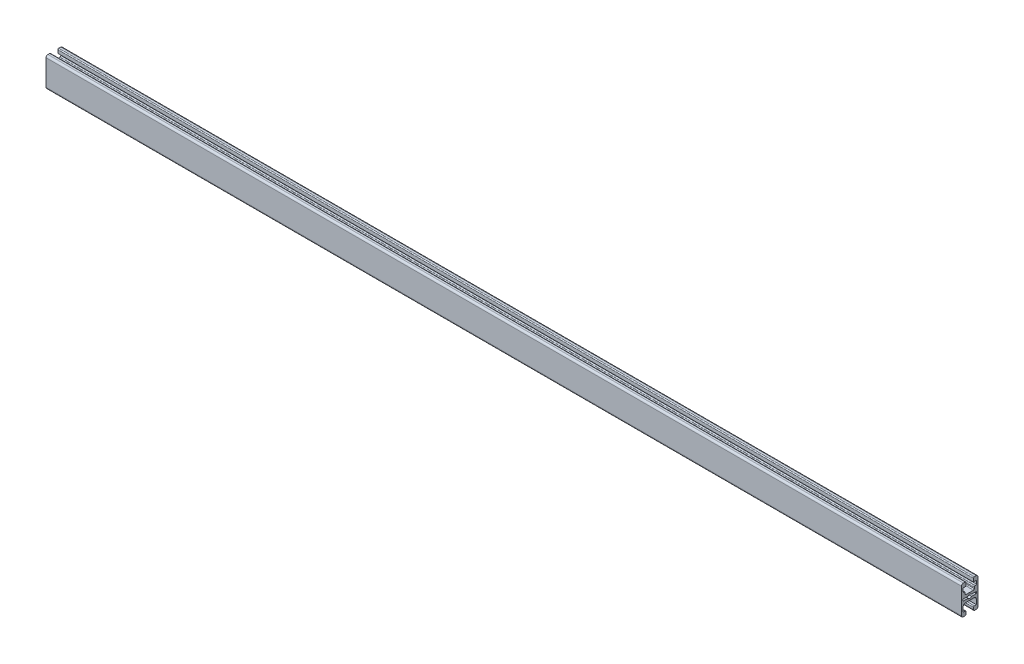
ISO-10303-21;
HEADER;
FILE_DESCRIPTION(('STEP AP214'),'2;1');
FILE_NAME('part.step','',(''),(''),'','','');
FILE_SCHEMA(('AUTOMOTIVE_DESIGN { 1 0 10303 214 1 1 1 1 }'));
ENDSEC;
DATA;
#1=APPLICATION_CONTEXT('core data for automotive mechanical design processes');
#2=APPLICATION_PROTOCOL_DEFINITION('international standard','automotive_design',2000,#1);
#3=PRODUCT_CONTEXT('',#1,'mechanical');
#4=PRODUCT('Part','Part','',(#3));
#5=PRODUCT_RELATED_PRODUCT_CATEGORY('part','',(#4));
#6=PRODUCT_DEFINITION_FORMATION('','',#4);
#7=PRODUCT_DEFINITION_CONTEXT('part definition',#1,'design');
#8=PRODUCT_DEFINITION('design','',#6,#7);
#9=PRODUCT_DEFINITION_SHAPE('','',#8);
#10=(LENGTH_UNIT() NAMED_UNIT(*) SI_UNIT(.MILLI.,.METRE.));
#11=(NAMED_UNIT(*) PLANE_ANGLE_UNIT() SI_UNIT($,.RADIAN.));
#12=(NAMED_UNIT(*) SI_UNIT($,.STERADIAN.) SOLID_ANGLE_UNIT());
#13=UNCERTAINTY_MEASURE_WITH_UNIT(LENGTH_MEASURE(1.E-05),#10,'distance_accuracy_value','');
#14=(GEOMETRIC_REPRESENTATION_CONTEXT(3) GLOBAL_UNCERTAINTY_ASSIGNED_CONTEXT((#13)) GLOBAL_UNIT_ASSIGNED_CONTEXT((#10,
#11,#12)) REPRESENTATION_CONTEXT('',''));
#15=CARTESIAN_POINT('',(0.,0.,0.));
#16=DIRECTION('',(0.,0.,1.));
#17=DIRECTION('',(1.,0.,0.));
#18=AXIS2_PLACEMENT_3D('',#15,#16,#17);
#19=CARTESIAN_POINT('',(1000.,14.,7.));
#20=DIRECTION('',(-1.,0.,0.));
#21=DIRECTION('',(0.,0.,1.));
#22=AXIS2_PLACEMENT_3D('',#19,#20,#21);
#23=CYLINDRICAL_SURFACE('',#22,2.);
#24=CARTESIAN_POINT('',(0.,14.,7.));
#25=DIRECTION('',(1.,0.,0.));
#26=DIRECTION('',(0.,0.,-1.));
#27=AXIS2_PLACEMENT_3D('',#24,#25,#26);
#28=CIRCLE('',#27,2.);
#29=CARTESIAN_POINT('',(0.,16.,7.));
#30=VERTEX_POINT('',#29);
#31=CARTESIAN_POINT('',(0.,14.,9.));
#32=VERTEX_POINT('',#31);
#33=EDGE_CURVE('E545',#30,#32,#28,.T.);
#34=ORIENTED_EDGE('',*,*,#33,.T.);
#35=DIRECTION('',(-1.,0.,0.));
#36=VECTOR('',#35,1.);
#37=CARTESIAN_POINT('',(1000.,14.,9.));
#38=LINE('',#37,#36);
#39=CARTESIAN_POINT('',(1000.,14.,9.));
#40=VERTEX_POINT('',#39);
#41=EDGE_CURVE('E13',#40,#32,#38,.T.);
#42=ORIENTED_EDGE('',*,*,#41,.F.);
#43=CARTESIAN_POINT('',(1000.,14.,7.));
#44=DIRECTION('',(1.,0.,0.));
#45=DIRECTION('',(0.,0.,-1.));
#46=AXIS2_PLACEMENT_3D('',#43,#44,#45);
#47=CIRCLE('',#46,2.);
#48=CARTESIAN_POINT('',(1000.,16.,7.));
#49=VERTEX_POINT('',#48);
#50=EDGE_CURVE('E793',#49,#40,#47,.T.);
#51=ORIENTED_EDGE('',*,*,#50,.F.);
#52=DIRECTION('',(-1.,0.,0.));
#53=VECTOR('',#52,1.);
#54=CARTESIAN_POINT('',(1000.,16.,7.));
#55=LINE('',#54,#53);
#56=EDGE_CURVE('E628',#49,#30,#55,.T.);
#57=ORIENTED_EDGE('',*,*,#56,.T.);
#58=EDGE_LOOP('',(#34,#42,#51,#57));
#59=FACE_BOUND('',#58,.T.);
#60=ADVANCED_FACE('F169',(#59),#23,.T.);
#61=CARTESIAN_POINT('',(1000.,-14.,9.));
#62=DIRECTION('',(0.,0.,-1.));
#63=DIRECTION('',(-1.,0.,0.));
#64=AXIS2_PLACEMENT_3D('',#61,#62,#63);
#65=PLANE('',#64);
#66=DIRECTION('',(0.,-1.,0.));
#67=VECTOR('',#66,1.);
#68=CARTESIAN_POINT('',(0.,-14.,9.));
#69=LINE('',#68,#67);
#70=CARTESIAN_POINT('',(0.,-14.,9.));
#71=VERTEX_POINT('',#70);
#72=EDGE_CURVE('E548',#32,#71,#69,.T.);
#73=ORIENTED_EDGE('',*,*,#72,.T.);
#74=DIRECTION('',(-1.,0.,0.));
#75=VECTOR('',#74,1.);
#76=CARTESIAN_POINT('',(1000.,-14.,9.));
#77=LINE('',#76,#75);
#78=CARTESIAN_POINT('',(1000.,-14.,9.));
#79=VERTEX_POINT('',#78);
#80=EDGE_CURVE('E179',#79,#71,#77,.T.);
#81=ORIENTED_EDGE('',*,*,#80,.F.);
#82=DIRECTION('',(0.,-1.,0.));
#83=VECTOR('',#82,1.);
#84=CARTESIAN_POINT('',(1000.,-14.,9.));
#85=LINE('',#84,#83);
#86=EDGE_CURVE('E795',#40,#79,#85,.T.);
#87=ORIENTED_EDGE('',*,*,#86,.F.);
#88=ORIENTED_EDGE('',*,*,#41,.T.);
#89=EDGE_LOOP('',(#73,#81,#87,#88));
#90=FACE_BOUND('',#89,.T.);
#91=ADVANCED_FACE('F898',(#90),#65,.F.);
#92=CARTESIAN_POINT('',(1000.,-14.,7.));
#93=DIRECTION('',(-1.,0.,0.));
#94=DIRECTION('',(0.,0.,1.));
#95=AXIS2_PLACEMENT_3D('',#92,#93,#94);
#96=CYLINDRICAL_SURFACE('',#95,2.);
#97=CARTESIAN_POINT('',(0.,-14.,7.));
#98=DIRECTION('',(1.,0.,0.));
#99=DIRECTION('',(0.,0.,-1.));
#100=AXIS2_PLACEMENT_3D('',#97,#98,#99);
#101=CIRCLE('',#100,2.);
#102=CARTESIAN_POINT('',(0.,-16.,7.));
#103=VERTEX_POINT('',#102);
#104=EDGE_CURVE('E550',#71,#103,#101,.T.);
#105=ORIENTED_EDGE('',*,*,#104,.T.);
#106=DIRECTION('',(-1.,0.,0.));
#107=VECTOR('',#106,1.);
#108=CARTESIAN_POINT('',(1000.,-16.,7.));
#109=LINE('',#108,#107);
#110=CARTESIAN_POINT('',(1000.,-16.,7.));
#111=VERTEX_POINT('',#110);
#112=EDGE_CURVE('E737',#111,#103,#109,.T.);
#113=ORIENTED_EDGE('',*,*,#112,.F.);
#114=CARTESIAN_POINT('',(1000.,-14.,7.));
#115=DIRECTION('',(1.,0.,0.));
#116=DIRECTION('',(0.,0.,-1.));
#117=AXIS2_PLACEMENT_3D('',#114,#115,#116);
#118=CIRCLE('',#117,2.);
#119=EDGE_CURVE('E797',#79,#111,#118,.T.);
#120=ORIENTED_EDGE('',*,*,#119,.F.);
#121=ORIENTED_EDGE('',*,*,#80,.T.);
#122=EDGE_LOOP('',(#105,#113,#120,#121));
#123=FACE_BOUND('',#122,.T.);
#124=ADVANCED_FACE('F903',(#123),#96,.T.);
#125=CARTESIAN_POINT('',(1000.,-16.,5.5));
#126=DIRECTION('',(0.,1.,0.));
#127=DIRECTION('',(0.,0.,1.));
#128=AXIS2_PLACEMENT_3D('',#125,#126,#127);
#129=PLANE('',#128);
#130=DIRECTION('',(0.,0.,-1.));
#131=VECTOR('',#130,1.);
#132=CARTESIAN_POINT('',(0.,-16.,5.5));
#133=LINE('',#132,#131);
#134=CARTESIAN_POINT('',(0.,-16.,5.5));
#135=VERTEX_POINT('',#134);
#136=EDGE_CURVE('E552',#103,#135,#133,.T.);
#137=ORIENTED_EDGE('',*,*,#136,.T.);
#138=DIRECTION('',(-1.,0.,0.));
#139=VECTOR('',#138,1.);
#140=CARTESIAN_POINT('',(1000.,-16.,5.5));
#141=LINE('',#140,#139);
#142=CARTESIAN_POINT('',(1000.,-16.,5.5));
#143=VERTEX_POINT('',#142);
#144=EDGE_CURVE('E734',#143,#135,#141,.T.);
#145=ORIENTED_EDGE('',*,*,#144,.F.);
#146=DIRECTION('',(0.,0.,-1.));
#147=VECTOR('',#146,1.);
#148=CARTESIAN_POINT('',(1000.,-16.,5.5));
#149=LINE('',#148,#147);
#150=EDGE_CURVE('E799',#111,#143,#149,.T.);
#151=ORIENTED_EDGE('',*,*,#150,.F.);
#152=ORIENTED_EDGE('',*,*,#112,.T.);
#153=EDGE_LOOP('',(#137,#145,#151,#152));
#154=FACE_BOUND('',#153,.T.);
#155=ADVANCED_FACE('F1069',(#154),#129,.F.);
#156=CARTESIAN_POINT('',(1000.,-14.5,5.50000000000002));
#157=DIRECTION('',(-1.,0.,0.));
#158=DIRECTION('',(0.,0.,1.));
#159=AXIS2_PLACEMENT_3D('',#156,#157,#158);
#160=CYLINDRICAL_SURFACE('',#159,1.50000000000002);
#161=CARTESIAN_POINT('',(0.,-14.5,5.50000000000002));
#162=DIRECTION('',(1.,0.,0.));
#163=DIRECTION('',(0.,0.,-1.));
#164=AXIS2_PLACEMENT_3D('',#161,#162,#163);
#165=CIRCLE('',#164,1.50000000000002);
#166=CARTESIAN_POINT('',(0.,-14.5,4.));
#167=VERTEX_POINT('',#166);
#168=EDGE_CURVE('E554',#135,#167,#165,.T.);
#169=ORIENTED_EDGE('',*,*,#168,.T.);
#170=DIRECTION('',(-1.,0.,0.));
#171=VECTOR('',#170,1.);
#172=CARTESIAN_POINT('',(1000.,-14.5,4.));
#173=LINE('',#172,#171);
#174=CARTESIAN_POINT('',(1000.,-14.5,4.));
#175=VERTEX_POINT('',#174);
#176=EDGE_CURVE('E731',#175,#167,#173,.T.);
#177=ORIENTED_EDGE('',*,*,#176,.F.);
#178=CARTESIAN_POINT('',(1000.,-14.5,5.50000000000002));
#179=DIRECTION('',(1.,0.,0.));
#180=DIRECTION('',(0.,0.,-1.));
#181=AXIS2_PLACEMENT_3D('',#178,#179,#180);
#182=CIRCLE('',#181,1.50000000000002);
#183=EDGE_CURVE('E801',#143,#175,#182,.T.);
#184=ORIENTED_EDGE('',*,*,#183,.F.);
#185=ORIENTED_EDGE('',*,*,#144,.T.);
#186=EDGE_LOOP('',(#169,#177,#184,#185));
#187=FACE_BOUND('',#186,.T.);
#188=ADVANCED_FACE('F1065',(#187),#160,.T.);
#189=CARTESIAN_POINT('',(1000.,-12.5,3.99999999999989));
#190=DIRECTION('',(0.,0.,1.));
#191=DIRECTION('',(0.,-1.,0.));
#192=AXIS2_PLACEMENT_3D('',#189,#190,#191);
#193=PLANE('',#192);
#194=DIRECTION('',(0.,1.,0.));
#195=VECTOR('',#194,1.);
#196=CARTESIAN_POINT('',(0.,-12.5,3.99999999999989));
#197=LINE('',#196,#195);
#198=CARTESIAN_POINT('',(0.,-12.5,3.99999999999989));
#199=VERTEX_POINT('',#198);
#200=EDGE_CURVE('E556',#167,#199,#197,.T.);
#201=ORIENTED_EDGE('',*,*,#200,.T.);
#202=DIRECTION('',(-1.,0.,0.));
#203=VECTOR('',#202,1.);
#204=CARTESIAN_POINT('',(1000.,-12.5,3.99999999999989));
#205=LINE('',#204,#203);
#206=CARTESIAN_POINT('',(1000.,-12.5,3.99999999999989));
#207=VERTEX_POINT('',#206);
#208=EDGE_CURVE('E728',#207,#199,#205,.T.);
#209=ORIENTED_EDGE('',*,*,#208,.F.);
#210=DIRECTION('',(0.,1.,0.));
#211=VECTOR('',#210,1.);
#212=CARTESIAN_POINT('',(1000.,-12.5,3.99999999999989));
#213=LINE('',#212,#211);
#214=EDGE_CURVE('E803',#175,#207,#213,.T.);
#215=ORIENTED_EDGE('',*,*,#214,.F.);
#216=ORIENTED_EDGE('',*,*,#176,.T.);
#217=EDGE_LOOP('',(#201,#209,#215,#216));
#218=FACE_BOUND('',#217,.T.);
#219=ADVANCED_FACE('F1061',(#218),#193,.F.);
#220=CARTESIAN_POINT('',(1000.,-12.5,4.99999999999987));
#221=DIRECTION('',(-1.,0.,0.));
#222=DIRECTION('',(0.,0.,1.));
#223=AXIS2_PLACEMENT_3D('',#220,#221,#222);
#224=CYLINDRICAL_SURFACE('',#223,0.999999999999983);
#225=CARTESIAN_POINT('',(0.,-12.5,4.99999999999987));
#226=DIRECTION('',(1.,0.,0.));
#227=DIRECTION('',(0.,0.,-1.));
#228=AXIS2_PLACEMENT_3D('',#225,#226,#227);
#229=CIRCLE('',#228,0.999999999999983);
#230=CARTESIAN_POINT('',(0.,-11.5,4.99999999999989));
#231=VERTEX_POINT('',#230);
#232=EDGE_CURVE('E558',#199,#231,#229,.T.);
#233=ORIENTED_EDGE('',*,*,#232,.T.);
#234=DIRECTION('',(-1.,0.,0.));
#235=VECTOR('',#234,1.);
#236=CARTESIAN_POINT('',(1000.,-11.5,4.99999999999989));
#237=LINE('',#236,#235);
#238=CARTESIAN_POINT('',(1000.,-11.5,4.99999999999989));
#239=VERTEX_POINT('',#238);
#240=EDGE_CURVE('E725',#239,#231,#237,.T.);
#241=ORIENTED_EDGE('',*,*,#240,.F.);
#242=CARTESIAN_POINT('',(1000.,-12.5,4.99999999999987));
#243=DIRECTION('',(1.,0.,0.));
#244=DIRECTION('',(0.,0.,-1.));
#245=AXIS2_PLACEMENT_3D('',#242,#243,#244);
#246=CIRCLE('',#245,0.999999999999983);
#247=EDGE_CURVE('E805',#207,#239,#246,.T.);
#248=ORIENTED_EDGE('',*,*,#247,.F.);
#249=ORIENTED_EDGE('',*,*,#208,.T.);
#250=EDGE_LOOP('',(#233,#241,#248,#249));
#251=FACE_BOUND('',#250,.T.);
#252=ADVANCED_FACE('F1057',(#251),#224,.T.);
#253=CARTESIAN_POINT('',(1000.,-11.5000000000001,7.17499999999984));
#254=DIRECTION('',(0.,-1.,0.));
#255=DIRECTION('',(0.,0.,-1.));
#256=AXIS2_PLACEMENT_3D('',#253,#254,#255);
#257=PLANE('',#256);
#258=DIRECTION('',(0.,0.,1.));
#259=VECTOR('',#258,1.);
#260=CARTESIAN_POINT('',(0.,-11.5000000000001,7.17499999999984));
#261=LINE('',#260,#259);
#262=CARTESIAN_POINT('',(0.,-11.5000000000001,7.17499999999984));
#263=VERTEX_POINT('',#262);
#264=EDGE_CURVE('E560',#231,#263,#261,.T.);
#265=ORIENTED_EDGE('',*,*,#264,.T.);
#266=DIRECTION('',(-1.,0.,0.));
#267=VECTOR('',#266,1.);
#268=CARTESIAN_POINT('',(1000.,-11.5000000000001,7.17499999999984));
#269=LINE('',#268,#267);
#270=CARTESIAN_POINT('',(1000.,-11.5000000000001,7.17499999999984));
#271=VERTEX_POINT('',#270);
#272=EDGE_CURVE('E722',#271,#263,#269,.T.);
#273=ORIENTED_EDGE('',*,*,#272,.F.);
#274=DIRECTION('',(0.,0.,1.));
#275=VECTOR('',#274,1.);
#276=CARTESIAN_POINT('',(1000.,-11.5000000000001,7.17499999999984));
#277=LINE('',#276,#275);
#278=EDGE_CURVE('E807',#239,#271,#277,.T.);
#279=ORIENTED_EDGE('',*,*,#278,.F.);
#280=ORIENTED_EDGE('',*,*,#240,.T.);
#281=EDGE_LOOP('',(#265,#273,#279,#280));
#282=FACE_BOUND('',#281,.T.);
#283=ADVANCED_FACE('F1053',(#282),#257,.F.);
#284=CARTESIAN_POINT('',(1000.,-6.24999999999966,7.17499999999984));
#285=DIRECTION('',(0.,0.,1.));
#286=DIRECTION('',(1.,0.,0.));
#287=AXIS2_PLACEMENT_3D('',#284,#285,#286);
#288=PLANE('',#287);
#289=DIRECTION('',(0.,1.,0.));
#290=VECTOR('',#289,1.);
#291=CARTESIAN_POINT('',(0.,-6.24999999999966,7.17499999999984));
#292=LINE('',#291,#290);
#293=CARTESIAN_POINT('',(0.,-6.24999999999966,7.17499999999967));
#294=VERTEX_POINT('',#293);
#295=EDGE_CURVE('E562',#263,#294,#292,.T.);
#296=ORIENTED_EDGE('',*,*,#295,.T.);
#297=DIRECTION('',(-1.,0.,0.));
#298=VECTOR('',#297,1.);
#299=CARTESIAN_POINT('',(1000.,-6.24999999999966,7.17499999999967));
#300=LINE('',#299,#298);
#301=CARTESIAN_POINT('',(1000.,-6.24999999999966,7.17499999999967));
#302=VERTEX_POINT('',#301);
#303=EDGE_CURVE('E719',#302,#294,#300,.T.);
#304=ORIENTED_EDGE('',*,*,#303,.F.);
#305=DIRECTION('',(0.,1.,0.));
#306=VECTOR('',#305,1.);
#307=CARTESIAN_POINT('',(1000.,-6.24999999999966,7.17499999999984));
#308=LINE('',#307,#306);
#309=EDGE_CURVE('E809',#271,#302,#308,.T.);
#310=ORIENTED_EDGE('',*,*,#309,.F.);
#311=ORIENTED_EDGE('',*,*,#272,.T.);
#312=EDGE_LOOP('',(#296,#304,#310,#311));
#313=FACE_BOUND('',#312,.T.);
#314=ADVANCED_FACE('F1049',(#313),#288,.F.);
#315=CARTESIAN_POINT('',(1000.,-6.24999999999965,4.67499999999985));
#316=DIRECTION('',(-1.,0.,0.));
#317=DIRECTION('',(0.,0.,1.));
#318=AXIS2_PLACEMENT_3D('',#315,#316,#317);
#319=CYLINDRICAL_SURFACE('',#318,2.49999999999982);
#320=CARTESIAN_POINT('',(0.,-6.24999999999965,4.67499999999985));
#321=DIRECTION('',(-1.,0.,0.));
#322=DIRECTION('',(0.,0.,-1.));
#323=AXIS2_PLACEMENT_3D('',#320,#321,#322);
#324=CIRCLE('',#323,2.49999999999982);
#325=CARTESIAN_POINT('',(0.,-3.75,4.67499999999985));
#326=VERTEX_POINT('',#325);
#327=EDGE_CURVE('E564',#294,#326,#324,.T.);
#328=ORIENTED_EDGE('',*,*,#327,.T.);
#329=DIRECTION('',(-1.,0.,0.));
#330=VECTOR('',#329,1.);
#331=CARTESIAN_POINT('',(1000.,-3.75,4.67499999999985));
#332=LINE('',#331,#330);
#333=CARTESIAN_POINT('',(1000.,-3.75,4.67499999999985));
#334=VERTEX_POINT('',#333);
#335=EDGE_CURVE('E716',#334,#326,#332,.T.);
#336=ORIENTED_EDGE('',*,*,#335,.F.);
#337=CARTESIAN_POINT('',(1000.,-6.24999999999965,4.67499999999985));
#338=DIRECTION('',(-1.,0.,0.));
#339=DIRECTION('',(0.,0.,-1.));
#340=AXIS2_PLACEMENT_3D('',#337,#338,#339);
#341=CIRCLE('',#340,2.49999999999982);
#342=EDGE_CURVE('E811',#302,#334,#341,.T.);
#343=ORIENTED_EDGE('',*,*,#342,.F.);
#344=ORIENTED_EDGE('',*,*,#303,.T.);
#345=EDGE_LOOP('',(#328,#336,#343,#344));
#346=FACE_BOUND('',#345,.T.);
#347=ADVANCED_FACE('F1045',(#346),#319,.F.);
#348=CARTESIAN_POINT('',(1000.,-3.75,-4.67499999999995));
#349=DIRECTION('',(0.,1.,0.));
#350=DIRECTION('',(0.,0.,1.));
#351=AXIS2_PLACEMENT_3D('',#348,#349,#350);
#352=PLANE('',#351);
#353=DIRECTION('',(0.,0.,-1.));
#354=VECTOR('',#353,1.);
#355=CARTESIAN_POINT('',(0.,-3.75,-4.67499999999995));
#356=LINE('',#355,#354);
#357=CARTESIAN_POINT('',(0.,-3.75,-4.67499999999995));
#358=VERTEX_POINT('',#357);
#359=EDGE_CURVE('E566',#326,#358,#356,.T.);
#360=ORIENTED_EDGE('',*,*,#359,.T.);
#361=DIRECTION('',(-1.,0.,0.));
#362=VECTOR('',#361,1.);
#363=CARTESIAN_POINT('',(1000.,-3.75,-4.67499999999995));
#364=LINE('',#363,#362);
#365=CARTESIAN_POINT('',(1000.,-3.75,-4.67499999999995));
#366=VERTEX_POINT('',#365);
#367=EDGE_CURVE('E713',#366,#358,#364,.T.);
#368=ORIENTED_EDGE('',*,*,#367,.F.);
#369=DIRECTION('',(0.,0.,-1.));
#370=VECTOR('',#369,1.);
#371=CARTESIAN_POINT('',(1000.,-3.75,-4.67499999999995));
#372=LINE('',#371,#370);
#373=EDGE_CURVE('E813',#334,#366,#372,.T.);
#374=ORIENTED_EDGE('',*,*,#373,.F.);
#375=ORIENTED_EDGE('',*,*,#335,.T.);
#376=EDGE_LOOP('',(#360,#368,#374,#375));
#377=FACE_BOUND('',#376,.T.);
#378=ADVANCED_FACE('F1041',(#377),#352,.F.);
#379=CARTESIAN_POINT('',(1000.,-6.25000000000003,-4.67499999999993));
#380=DIRECTION('',(-1.,0.,0.));
#381=DIRECTION('',(0.,0.,1.));
#382=AXIS2_PLACEMENT_3D('',#379,#380,#381);
#383=CYLINDRICAL_SURFACE('',#382,2.50000000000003);
#384=CARTESIAN_POINT('',(0.,-6.25000000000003,-4.67499999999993));
#385=DIRECTION('',(-1.,0.,0.));
#386=DIRECTION('',(0.,0.,-1.));
#387=AXIS2_PLACEMENT_3D('',#384,#385,#386);
#388=CIRCLE('',#387,2.50000000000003);
#389=CARTESIAN_POINT('',(0.,-6.25,-7.17499999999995));
#390=VERTEX_POINT('',#389);
#391=EDGE_CURVE('E568',#358,#390,#388,.T.);
#392=ORIENTED_EDGE('',*,*,#391,.T.);
#393=DIRECTION('',(-1.,0.,0.));
#394=VECTOR('',#393,1.);
#395=CARTESIAN_POINT('',(1000.,-6.25,-7.17499999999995));
#396=LINE('',#395,#394);
#397=CARTESIAN_POINT('',(1000.,-6.25,-7.17499999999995));
#398=VERTEX_POINT('',#397);
#399=EDGE_CURVE('E710',#398,#390,#396,.T.);
#400=ORIENTED_EDGE('',*,*,#399,.F.);
#401=CARTESIAN_POINT('',(1000.,-6.25000000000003,-4.67499999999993));
#402=DIRECTION('',(-1.,0.,0.));
#403=DIRECTION('',(0.,0.,-1.));
#404=AXIS2_PLACEMENT_3D('',#401,#402,#403);
#405=CIRCLE('',#404,2.50000000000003);
#406=EDGE_CURVE('E815',#366,#398,#405,.T.);
#407=ORIENTED_EDGE('',*,*,#406,.F.);
#408=ORIENTED_EDGE('',*,*,#367,.T.);
#409=EDGE_LOOP('',(#392,#400,#407,#408));
#410=FACE_BOUND('',#409,.T.);
#411=ADVANCED_FACE('F1037',(#410),#383,.F.);
#412=CARTESIAN_POINT('',(1000.,-11.5000000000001,-7.17500000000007));
#413=DIRECTION('',(0.,0.,-1.));
#414=DIRECTION('',(0.,1.,0.));
#415=AXIS2_PLACEMENT_3D('',#412,#413,#414);
#416=PLANE('',#415);
#417=DIRECTION('',(0.,-1.,0.));
#418=VECTOR('',#417,1.);
#419=CARTESIAN_POINT('',(0.,-11.5000000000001,-7.17500000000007));
#420=LINE('',#419,#418);
#421=CARTESIAN_POINT('',(0.,-11.5000000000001,-7.17500000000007));
#422=VERTEX_POINT('',#421);
#423=EDGE_CURVE('E570',#390,#422,#420,.T.);
#424=ORIENTED_EDGE('',*,*,#423,.T.);
#425=DIRECTION('',(-1.,0.,0.));
#426=VECTOR('',#425,1.);
#427=CARTESIAN_POINT('',(1000.,-11.5000000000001,-7.17500000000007));
#428=LINE('',#427,#426);
#429=CARTESIAN_POINT('',(1000.,-11.5000000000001,-7.17500000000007));
#430=VERTEX_POINT('',#429);
#431=EDGE_CURVE('E707',#430,#422,#428,.T.);
#432=ORIENTED_EDGE('',*,*,#431,.F.);
#433=DIRECTION('',(0.,-1.,0.));
#434=VECTOR('',#433,1.);
#435=CARTESIAN_POINT('',(1000.,-11.5000000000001,-7.17500000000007));
#436=LINE('',#435,#434);
#437=EDGE_CURVE('E817',#398,#430,#436,.T.);
#438=ORIENTED_EDGE('',*,*,#437,.F.);
#439=ORIENTED_EDGE('',*,*,#399,.T.);
#440=EDGE_LOOP('',(#424,#432,#438,#439));
#441=FACE_BOUND('',#440,.T.);
#442=ADVANCED_FACE('F1033',(#441),#416,.F.);
#443=CARTESIAN_POINT('',(1000.,-11.5,-4.99999999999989));
#444=DIRECTION('',(0.,-1.,0.));
#445=DIRECTION('',(0.,0.,-1.));
#446=AXIS2_PLACEMENT_3D('',#443,#444,#445);
#447=PLANE('',#446);
#448=DIRECTION('',(0.,0.,1.));
#449=VECTOR('',#448,1.);
#450=CARTESIAN_POINT('',(0.,-11.5,-4.99999999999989));
#451=LINE('',#450,#449);
#452=CARTESIAN_POINT('',(0.,-11.5,-4.99999999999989));
#453=VERTEX_POINT('',#452);
#454=EDGE_CURVE('E572',#422,#453,#451,.T.);
#455=ORIENTED_EDGE('',*,*,#454,.T.);
#456=DIRECTION('',(-1.,0.,0.));
#457=VECTOR('',#456,1.);
#458=CARTESIAN_POINT('',(1000.,-11.5,-4.99999999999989));
#459=LINE('',#458,#457);
#460=CARTESIAN_POINT('',(1000.,-11.5,-4.99999999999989));
#461=VERTEX_POINT('',#460);
#462=EDGE_CURVE('E704',#461,#453,#459,.T.);
#463=ORIENTED_EDGE('',*,*,#462,.F.);
#464=DIRECTION('',(0.,0.,1.));
#465=VECTOR('',#464,1.);
#466=CARTESIAN_POINT('',(1000.,-11.5,-4.99999999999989));
#467=LINE('',#466,#465);
#468=EDGE_CURVE('E819',#430,#461,#467,.T.);
#469=ORIENTED_EDGE('',*,*,#468,.F.);
#470=ORIENTED_EDGE('',*,*,#431,.T.);
#471=EDGE_LOOP('',(#455,#463,#469,#470));
#472=FACE_BOUND('',#471,.T.);
#473=ADVANCED_FACE('F1029',(#472),#447,.F.);
#474=CARTESIAN_POINT('',(1000.,-12.5,-4.99999999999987));
#475=DIRECTION('',(-1.,0.,0.));
#476=DIRECTION('',(0.,0.,1.));
#477=AXIS2_PLACEMENT_3D('',#474,#475,#476);
#478=CYLINDRICAL_SURFACE('',#477,0.999999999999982);
#479=CARTESIAN_POINT('',(0.,-12.5,-4.99999999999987));
#480=DIRECTION('',(1.,0.,0.));
#481=DIRECTION('',(0.,0.,-1.));
#482=AXIS2_PLACEMENT_3D('',#479,#480,#481);
#483=CIRCLE('',#482,0.999999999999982);
#484=CARTESIAN_POINT('',(0.,-12.5,-3.99999999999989));
#485=VERTEX_POINT('',#484);
#486=EDGE_CURVE('E574',#453,#485,#483,.T.);
#487=ORIENTED_EDGE('',*,*,#486,.T.);
#488=DIRECTION('',(-1.,0.,0.));
#489=VECTOR('',#488,1.);
#490=CARTESIAN_POINT('',(1000.,-12.5,-3.99999999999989));
#491=LINE('',#490,#489);
#492=CARTESIAN_POINT('',(1000.,-12.5,-3.99999999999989));
#493=VERTEX_POINT('',#492);
#494=EDGE_CURVE('E701',#493,#485,#491,.T.);
#495=ORIENTED_EDGE('',*,*,#494,.F.);
#496=CARTESIAN_POINT('',(1000.,-12.5,-4.99999999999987));
#497=DIRECTION('',(1.,0.,0.));
#498=DIRECTION('',(0.,0.,-1.));
#499=AXIS2_PLACEMENT_3D('',#496,#497,#498);
#500=CIRCLE('',#499,0.999999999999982);
#501=EDGE_CURVE('E821',#461,#493,#500,.T.);
#502=ORIENTED_EDGE('',*,*,#501,.F.);
#503=ORIENTED_EDGE('',*,*,#462,.T.);
#504=EDGE_LOOP('',(#487,#495,#502,#503));
#505=FACE_BOUND('',#504,.T.);
#506=ADVANCED_FACE('F1025',(#505),#478,.T.);
#507=CARTESIAN_POINT('',(1000.,-14.5,-4.));
#508=DIRECTION('',(0.,0.,-1.));
#509=DIRECTION('',(0.,1.,0.));
#510=AXIS2_PLACEMENT_3D('',#507,#508,#509);
#511=PLANE('',#510);
#512=DIRECTION('',(0.,-1.,0.));
#513=VECTOR('',#512,1.);
#514=CARTESIAN_POINT('',(0.,-14.5,-4.));
#515=LINE('',#514,#513);
#516=CARTESIAN_POINT('',(0.,-14.5,-4.));
#517=VERTEX_POINT('',#516);
#518=EDGE_CURVE('E576',#485,#517,#515,.T.);
#519=ORIENTED_EDGE('',*,*,#518,.T.);
#520=DIRECTION('',(-1.,0.,0.));
#521=VECTOR('',#520,1.);
#522=CARTESIAN_POINT('',(1000.,-14.5,-4.));
#523=LINE('',#522,#521);
#524=CARTESIAN_POINT('',(1000.,-14.5,-4.));
#525=VERTEX_POINT('',#524);
#526=EDGE_CURVE('E698',#525,#517,#523,.T.);
#527=ORIENTED_EDGE('',*,*,#526,.F.);
#528=DIRECTION('',(0.,-1.,0.));
#529=VECTOR('',#528,1.);
#530=CARTESIAN_POINT('',(1000.,-14.5,-4.));
#531=LINE('',#530,#529);
#532=EDGE_CURVE('E823',#493,#525,#531,.T.);
#533=ORIENTED_EDGE('',*,*,#532,.F.);
#534=ORIENTED_EDGE('',*,*,#494,.T.);
#535=EDGE_LOOP('',(#519,#527,#533,#534));
#536=FACE_BOUND('',#535,.T.);
#537=ADVANCED_FACE('F1021',(#536),#511,.F.);
#538=CARTESIAN_POINT('',(1000.,-14.5,-5.50000000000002));
#539=DIRECTION('',(-1.,0.,0.));
#540=DIRECTION('',(0.,0.,1.));
#541=AXIS2_PLACEMENT_3D('',#538,#539,#540);
#542=CYLINDRICAL_SURFACE('',#541,1.50000000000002);
#543=CARTESIAN_POINT('',(0.,-14.5,-5.50000000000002));
#544=DIRECTION('',(1.,0.,0.));
#545=DIRECTION('',(0.,0.,-1.));
#546=AXIS2_PLACEMENT_3D('',#543,#544,#545);
#547=CIRCLE('',#546,1.50000000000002);
#548=CARTESIAN_POINT('',(0.,-16.,-5.5));
#549=VERTEX_POINT('',#548);
#550=EDGE_CURVE('E578',#517,#549,#547,.T.);
#551=ORIENTED_EDGE('',*,*,#550,.T.);
#552=DIRECTION('',(-1.,0.,0.));
#553=VECTOR('',#552,1.);
#554=CARTESIAN_POINT('',(1000.,-16.,-5.5));
#555=LINE('',#554,#553);
#556=CARTESIAN_POINT('',(1000.,-16.,-5.5));
#557=VERTEX_POINT('',#556);
#558=EDGE_CURVE('E695',#557,#549,#555,.T.);
#559=ORIENTED_EDGE('',*,*,#558,.F.);
#560=CARTESIAN_POINT('',(1000.,-14.5,-5.50000000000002));
#561=DIRECTION('',(1.,0.,0.));
#562=DIRECTION('',(0.,0.,-1.));
#563=AXIS2_PLACEMENT_3D('',#560,#561,#562);
#564=CIRCLE('',#563,1.50000000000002);
#565=EDGE_CURVE('E825',#525,#557,#564,.T.);
#566=ORIENTED_EDGE('',*,*,#565,.F.);
#567=ORIENTED_EDGE('',*,*,#526,.T.);
#568=EDGE_LOOP('',(#551,#559,#566,#567));
#569=FACE_BOUND('',#568,.T.);
#570=ADVANCED_FACE('F1017',(#569),#542,.T.);
#571=CARTESIAN_POINT('',(1000.,-16.,-7.));
#572=DIRECTION('',(0.,1.,0.));
#573=DIRECTION('',(0.,0.,1.));
#574=AXIS2_PLACEMENT_3D('',#571,#572,#573);
#575=PLANE('',#574);
#576=DIRECTION('',(0.,0.,-1.));
#577=VECTOR('',#576,1.);
#578=CARTESIAN_POINT('',(0.,-16.,-7.));
#579=LINE('',#578,#577);
#580=CARTESIAN_POINT('',(0.,-16.,-7.));
#581=VERTEX_POINT('',#580);
#582=EDGE_CURVE('E580',#549,#581,#579,.T.);
#583=ORIENTED_EDGE('',*,*,#582,.T.);
#584=DIRECTION('',(-1.,0.,0.));
#585=VECTOR('',#584,1.);
#586=CARTESIAN_POINT('',(1000.,-16.,-7.));
#587=LINE('',#586,#585);
#588=CARTESIAN_POINT('',(1000.,-16.,-7.));
#589=VERTEX_POINT('',#588);
#590=EDGE_CURVE('E692',#589,#581,#587,.T.);
#591=ORIENTED_EDGE('',*,*,#590,.F.);
#592=DIRECTION('',(0.,0.,-1.));
#593=VECTOR('',#592,1.);
#594=CARTESIAN_POINT('',(1000.,-16.,-7.));
#595=LINE('',#594,#593);
#596=EDGE_CURVE('E827',#557,#589,#595,.T.);
#597=ORIENTED_EDGE('',*,*,#596,.F.);
#598=ORIENTED_EDGE('',*,*,#558,.T.);
#599=EDGE_LOOP('',(#583,#591,#597,#598));
#600=FACE_BOUND('',#599,.T.);
#601=ADVANCED_FACE('F1013',(#600),#575,.F.);
#602=CARTESIAN_POINT('',(1000.,-14.,-7.));
#603=DIRECTION('',(-1.,0.,0.));
#604=DIRECTION('',(0.,0.,1.));
#605=AXIS2_PLACEMENT_3D('',#602,#603,#604);
#606=CYLINDRICAL_SURFACE('',#605,2.);
#607=CARTESIAN_POINT('',(0.,-14.,-7.));
#608=DIRECTION('',(1.,0.,0.));
#609=DIRECTION('',(0.,0.,-1.));
#610=AXIS2_PLACEMENT_3D('',#607,#608,#609);
#611=CIRCLE('',#610,2.);
#612=CARTESIAN_POINT('',(0.,-14.,-9.));
#613=VERTEX_POINT('',#612);
#614=EDGE_CURVE('E582',#581,#613,#611,.T.);
#615=ORIENTED_EDGE('',*,*,#614,.T.);
#616=DIRECTION('',(-1.,0.,0.));
#617=VECTOR('',#616,1.);
#618=CARTESIAN_POINT('',(1000.,-14.,-9.));
#619=LINE('',#618,#617);
#620=CARTESIAN_POINT('',(1000.,-14.,-9.));
#621=VERTEX_POINT('',#620);
#622=EDGE_CURVE('E689',#621,#613,#619,.T.);
#623=ORIENTED_EDGE('',*,*,#622,.F.);
#624=CARTESIAN_POINT('',(1000.,-14.,-7.));
#625=DIRECTION('',(1.,0.,0.));
#626=DIRECTION('',(0.,0.,-1.));
#627=AXIS2_PLACEMENT_3D('',#624,#625,#626);
#628=CIRCLE('',#627,2.);
#629=EDGE_CURVE('E829',#589,#621,#628,.T.);
#630=ORIENTED_EDGE('',*,*,#629,.F.);
#631=ORIENTED_EDGE('',*,*,#590,.T.);
#632=EDGE_LOOP('',(#615,#623,#630,#631));
#633=FACE_BOUND('',#632,.T.);
#634=ADVANCED_FACE('F1009',(#633),#606,.T.);
#635=CARTESIAN_POINT('',(1000.,14.,-9.));
#636=DIRECTION('',(0.,0.,1.));
#637=DIRECTION('',(1.,0.,0.));
#638=AXIS2_PLACEMENT_3D('',#635,#636,#637);
#639=PLANE('',#638);
#640=DIRECTION('',(0.,1.,0.));
#641=VECTOR('',#640,1.);
#642=CARTESIAN_POINT('',(0.,14.,-9.));
#643=LINE('',#642,#641);
#644=CARTESIAN_POINT('',(0.,14.,-9.));
#645=VERTEX_POINT('',#644);
#646=EDGE_CURVE('E584',#613,#645,#643,.T.);
#647=ORIENTED_EDGE('',*,*,#646,.T.);
#648=DIRECTION('',(-1.,0.,0.));
#649=VECTOR('',#648,1.);
#650=CARTESIAN_POINT('',(1000.,14.,-9.));
#651=LINE('',#650,#649);
#652=CARTESIAN_POINT('',(1000.,14.,-9.));
#653=VERTEX_POINT('',#652);
#654=EDGE_CURVE('E686',#653,#645,#651,.T.);
#655=ORIENTED_EDGE('',*,*,#654,.F.);
#656=DIRECTION('',(0.,1.,0.));
#657=VECTOR('',#656,1.);
#658=CARTESIAN_POINT('',(1000.,14.,-9.));
#659=LINE('',#658,#657);
#660=EDGE_CURVE('E831',#621,#653,#659,.T.);
#661=ORIENTED_EDGE('',*,*,#660,.F.);
#662=ORIENTED_EDGE('',*,*,#622,.T.);
#663=EDGE_LOOP('',(#647,#655,#661,#662));
#664=FACE_BOUND('',#663,.T.);
#665=ADVANCED_FACE('F1005',(#664),#639,.F.);
#666=CARTESIAN_POINT('',(1000.,14.,-7.));
#667=DIRECTION('',(-1.,0.,0.));
#668=DIRECTION('',(0.,0.,1.));
#669=AXIS2_PLACEMENT_3D('',#666,#667,#668);
#670=CYLINDRICAL_SURFACE('',#669,2.);
#671=CARTESIAN_POINT('',(0.,14.,-7.));
#672=DIRECTION('',(1.,0.,0.));
#673=DIRECTION('',(0.,0.,-1.));
#674=AXIS2_PLACEMENT_3D('',#671,#672,#673);
#675=CIRCLE('',#674,2.);
#676=CARTESIAN_POINT('',(0.,16.,-7.));
#677=VERTEX_POINT('',#676);
#678=EDGE_CURVE('E586',#645,#677,#675,.T.);
#679=ORIENTED_EDGE('',*,*,#678,.T.);
#680=DIRECTION('',(-1.,0.,0.));
#681=VECTOR('',#680,1.);
#682=CARTESIAN_POINT('',(1000.,16.,-7.));
#683=LINE('',#682,#681);
#684=CARTESIAN_POINT('',(1000.,16.,-7.));
#685=VERTEX_POINT('',#684);
#686=EDGE_CURVE('E683',#685,#677,#683,.T.);
#687=ORIENTED_EDGE('',*,*,#686,.F.);
#688=CARTESIAN_POINT('',(1000.,14.,-7.));
#689=DIRECTION('',(1.,0.,0.));
#690=DIRECTION('',(0.,0.,-1.));
#691=AXIS2_PLACEMENT_3D('',#688,#689,#690);
#692=CIRCLE('',#691,2.);
#693=EDGE_CURVE('E833',#653,#685,#692,.T.);
#694=ORIENTED_EDGE('',*,*,#693,.F.);
#695=ORIENTED_EDGE('',*,*,#654,.T.);
#696=EDGE_LOOP('',(#679,#687,#694,#695));
#697=FACE_BOUND('',#696,.T.);
#698=ADVANCED_FACE('F1001',(#697),#670,.T.);
#699=CARTESIAN_POINT('',(1000.,16.,-5.));
#700=DIRECTION('',(0.,-1.,0.));
#701=DIRECTION('',(0.,0.,-1.));
#702=AXIS2_PLACEMENT_3D('',#699,#700,#701);
#703=PLANE('',#702);
#704=DIRECTION('',(0.,0.,1.));
#705=VECTOR('',#704,1.);
#706=CARTESIAN_POINT('',(0.,16.,-5.));
#707=LINE('',#706,#705);
#708=CARTESIAN_POINT('',(0.,16.,-5.));
#709=VERTEX_POINT('',#708);
#710=EDGE_CURVE('E588',#677,#709,#707,.T.);
#711=ORIENTED_EDGE('',*,*,#710,.T.);
#712=DIRECTION('',(-1.,0.,0.));
#713=VECTOR('',#712,1.);
#714=CARTESIAN_POINT('',(1000.,16.,-5.));
#715=LINE('',#714,#713);
#716=CARTESIAN_POINT('',(1000.,16.,-5.));
#717=VERTEX_POINT('',#716);
#718=EDGE_CURVE('E680',#717,#709,#715,.T.);
#719=ORIENTED_EDGE('',*,*,#718,.F.);
#720=DIRECTION('',(0.,0.,1.));
#721=VECTOR('',#720,1.);
#722=CARTESIAN_POINT('',(1000.,16.,-5.));
#723=LINE('',#722,#721);
#724=EDGE_CURVE('E835',#685,#717,#723,.T.);
#725=ORIENTED_EDGE('',*,*,#724,.F.);
#726=ORIENTED_EDGE('',*,*,#686,.T.);
#727=EDGE_LOOP('',(#711,#719,#725,#726));
#728=FACE_BOUND('',#727,.T.);
#729=ADVANCED_FACE('F997',(#728),#703,.F.);
#730=CARTESIAN_POINT('',(1000.,15.,-5.));
#731=DIRECTION('',(-1.,0.,0.));
#732=DIRECTION('',(0.,0.,1.));
#733=AXIS2_PLACEMENT_3D('',#730,#731,#732);
#734=CYLINDRICAL_SURFACE('',#733,1.);
#735=CARTESIAN_POINT('',(0.,15.,-5.));
#736=DIRECTION('',(1.,0.,0.));
#737=DIRECTION('',(0.,0.,-1.));
#738=AXIS2_PLACEMENT_3D('',#735,#736,#737);
#739=CIRCLE('',#738,1.);
#740=CARTESIAN_POINT('',(0.,15.,-4.));
#741=VERTEX_POINT('',#740);
#742=EDGE_CURVE('E590',#709,#741,#739,.T.);
#743=ORIENTED_EDGE('',*,*,#742,.T.);
#744=DIRECTION('',(-1.,0.,0.));
#745=VECTOR('',#744,1.);
#746=CARTESIAN_POINT('',(1000.,15.,-4.));
#747=LINE('',#746,#745);
#748=CARTESIAN_POINT('',(1000.,15.,-4.));
#749=VERTEX_POINT('',#748);
#750=EDGE_CURVE('E677',#749,#741,#747,.T.);
#751=ORIENTED_EDGE('',*,*,#750,.F.);
#752=CARTESIAN_POINT('',(1000.,15.,-5.));
#753=DIRECTION('',(1.,0.,0.));
#754=DIRECTION('',(0.,0.,-1.));
#755=AXIS2_PLACEMENT_3D('',#752,#753,#754);
#756=CIRCLE('',#755,1.);
#757=EDGE_CURVE('E837',#717,#749,#756,.T.);
#758=ORIENTED_EDGE('',*,*,#757,.F.);
#759=ORIENTED_EDGE('',*,*,#718,.T.);
#760=EDGE_LOOP('',(#743,#751,#758,#759));
#761=FACE_BOUND('',#760,.T.);
#762=ADVANCED_FACE('F993',(#761),#734,.T.);
#763=CARTESIAN_POINT('',(1000.,11.5,-4.));
#764=DIRECTION('',(0.,0.,-1.));
#765=DIRECTION('',(-1.,0.,0.));
#766=AXIS2_PLACEMENT_3D('',#763,#764,#765);
#767=PLANE('',#766);
#768=DIRECTION('',(0.,-1.,0.));
#769=VECTOR('',#768,1.);
#770=CARTESIAN_POINT('',(0.,11.5,-4.));
#771=LINE('',#770,#769);
#772=CARTESIAN_POINT('',(0.,11.5,-4.));
#773=VERTEX_POINT('',#772);
#774=EDGE_CURVE('E592',#741,#773,#771,.T.);
#775=ORIENTED_EDGE('',*,*,#774,.T.);
#776=DIRECTION('',(-1.,0.,0.));
#777=VECTOR('',#776,1.);
#778=CARTESIAN_POINT('',(1000.,11.5,-4.));
#779=LINE('',#778,#777);
#780=CARTESIAN_POINT('',(1000.,11.5,-4.));
#781=VERTEX_POINT('',#780);
#782=EDGE_CURVE('E674',#781,#773,#779,.T.);
#783=ORIENTED_EDGE('',*,*,#782,.F.);
#784=DIRECTION('',(0.,-1.,0.));
#785=VECTOR('',#784,1.);
#786=CARTESIAN_POINT('',(1000.,11.5,-4.));
#787=LINE('',#786,#785);
#788=EDGE_CURVE('E839',#749,#781,#787,.T.);
#789=ORIENTED_EDGE('',*,*,#788,.F.);
#790=ORIENTED_EDGE('',*,*,#750,.T.);
#791=EDGE_LOOP('',(#775,#783,#789,#790));
#792=FACE_BOUND('',#791,.T.);
#793=ADVANCED_FACE('F989',(#792),#767,.F.);
#794=CARTESIAN_POINT('',(1000.,11.4999999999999,-7.17500000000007));
#795=DIRECTION('',(0.,1.,0.));
#796=DIRECTION('',(0.,0.,1.));
#797=AXIS2_PLACEMENT_3D('',#794,#795,#796);
#798=PLANE('',#797);
#799=DIRECTION('',(0.,0.,-1.));
#800=VECTOR('',#799,1.);
#801=CARTESIAN_POINT('',(0.,11.4999999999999,-7.17500000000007));
#802=LINE('',#801,#800);
#803=CARTESIAN_POINT('',(0.,11.4999999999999,-7.17500000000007));
#804=VERTEX_POINT('',#803);
#805=EDGE_CURVE('E594',#773,#804,#802,.T.);
#806=ORIENTED_EDGE('',*,*,#805,.T.);
#807=DIRECTION('',(-1.,0.,0.));
#808=VECTOR('',#807,1.);
#809=CARTESIAN_POINT('',(1000.,11.4999999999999,-7.17500000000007));
#810=LINE('',#809,#808);
#811=CARTESIAN_POINT('',(1000.,11.4999999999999,-7.17500000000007));
#812=VERTEX_POINT('',#811);
#813=EDGE_CURVE('E671',#812,#804,#810,.T.);
#814=ORIENTED_EDGE('',*,*,#813,.F.);
#815=DIRECTION('',(0.,0.,-1.));
#816=VECTOR('',#815,1.);
#817=CARTESIAN_POINT('',(1000.,11.4999999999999,-7.17500000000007));
#818=LINE('',#817,#816);
#819=EDGE_CURVE('E841',#781,#812,#818,.T.);
#820=ORIENTED_EDGE('',*,*,#819,.F.);
#821=ORIENTED_EDGE('',*,*,#782,.T.);
#822=EDGE_LOOP('',(#806,#814,#820,#821));
#823=FACE_BOUND('',#822,.T.);
#824=ADVANCED_FACE('F985',(#823),#798,.F.);
#825=CARTESIAN_POINT('',(1000.,8.,-7.17499999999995));
#826=DIRECTION('',(0.,0.,-1.));
#827=DIRECTION('',(0.,1.,0.));
#828=AXIS2_PLACEMENT_3D('',#825,#826,#827);
#829=PLANE('',#828);
#830=DIRECTION('',(0.,-1.,0.));
#831=VECTOR('',#830,1.);
#832=CARTESIAN_POINT('',(0.,8.,-7.17499999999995));
#833=LINE('',#832,#831);
#834=CARTESIAN_POINT('',(0.,8.,-7.17499999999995));
#835=VERTEX_POINT('',#834);
#836=EDGE_CURVE('E596',#804,#835,#833,.T.);
#837=ORIENTED_EDGE('',*,*,#836,.T.);
#838=DIRECTION('',(-1.,0.,0.));
#839=VECTOR('',#838,1.);
#840=CARTESIAN_POINT('',(1000.,8.,-7.17499999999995));
#841=LINE('',#840,#839);
#842=CARTESIAN_POINT('',(1000.,8.,-7.17499999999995));
#843=VERTEX_POINT('',#842);
#844=EDGE_CURVE('E668',#843,#835,#841,.T.);
#845=ORIENTED_EDGE('',*,*,#844,.F.);
#846=DIRECTION('',(0.,-1.,0.));
#847=VECTOR('',#846,1.);
#848=CARTESIAN_POINT('',(1000.,8.,-7.17499999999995));
#849=LINE('',#848,#847);
#850=EDGE_CURVE('E843',#812,#843,#849,.T.);
#851=ORIENTED_EDGE('',*,*,#850,.F.);
#852=ORIENTED_EDGE('',*,*,#813,.T.);
#853=EDGE_LOOP('',(#837,#845,#851,#852));
#854=FACE_BOUND('',#853,.T.);
#855=ADVANCED_FACE('F981',(#854),#829,.F.);
#856=CARTESIAN_POINT('',(1000.,8.00000000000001,-6.17499999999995));
#857=DIRECTION('',(-1.,0.,0.));
#858=DIRECTION('',(0.,0.,1.));
#859=AXIS2_PLACEMENT_3D('',#856,#857,#858);
#860=CYLINDRICAL_SURFACE('',#859,1.00000000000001);
#861=CARTESIAN_POINT('',(0.,8.00000000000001,-6.17499999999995));
#862=DIRECTION('',(-1.,0.,0.));
#863=DIRECTION('',(0.,0.,-1.));
#864=AXIS2_PLACEMENT_3D('',#861,#862,#863);
#865=CIRCLE('',#864,1.00000000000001);
#866=CARTESIAN_POINT('',(0.,7.,-6.17499999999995));
#867=VERTEX_POINT('',#866);
#868=EDGE_CURVE('E598',#835,#867,#865,.T.);
#869=ORIENTED_EDGE('',*,*,#868,.T.);
#870=DIRECTION('',(-1.,0.,0.));
#871=VECTOR('',#870,1.);
#872=CARTESIAN_POINT('',(1000.,7.,-6.17499999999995));
#873=LINE('',#872,#871);
#874=CARTESIAN_POINT('',(1000.,7.,-6.17499999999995));
#875=VERTEX_POINT('',#874);
#876=EDGE_CURVE('E665',#875,#867,#873,.T.);
#877=ORIENTED_EDGE('',*,*,#876,.F.);
#878=CARTESIAN_POINT('',(1000.,8.00000000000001,-6.17499999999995));
#879=DIRECTION('',(-1.,0.,0.));
#880=DIRECTION('',(0.,0.,-1.));
#881=AXIS2_PLACEMENT_3D('',#878,#879,#880);
#882=CIRCLE('',#881,1.00000000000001);
#883=EDGE_CURVE('E845',#843,#875,#882,.T.);
#884=ORIENTED_EDGE('',*,*,#883,.F.);
#885=ORIENTED_EDGE('',*,*,#844,.T.);
#886=EDGE_LOOP('',(#869,#877,#884,#885));
#887=FACE_BOUND('',#886,.T.);
#888=ADVANCED_FACE('F977',(#887),#860,.F.);
#889=CARTESIAN_POINT('',(1000.,7.,-5.99999999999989));
#890=DIRECTION('',(0.,-1.,0.));
#891=DIRECTION('',(0.,0.,-1.));
#892=AXIS2_PLACEMENT_3D('',#889,#890,#891);
#893=PLANE('',#892);
#894=DIRECTION('',(0.,0.,1.));
#895=VECTOR('',#894,1.);
#896=CARTESIAN_POINT('',(0.,7.,-5.99999999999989));
#897=LINE('',#896,#895);
#898=CARTESIAN_POINT('',(0.,7.,-5.99999999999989));
#899=VERTEX_POINT('',#898);
#900=EDGE_CURVE('E600',#867,#899,#897,.T.);
#901=ORIENTED_EDGE('',*,*,#900,.T.);
#902=DIRECTION('',(-1.,0.,0.));
#903=VECTOR('',#902,1.);
#904=CARTESIAN_POINT('',(1000.,7.,-5.99999999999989));
#905=LINE('',#904,#903);
#906=CARTESIAN_POINT('',(1000.,7.,-5.99999999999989));
#907=VERTEX_POINT('',#906);
#908=EDGE_CURVE('E662',#907,#899,#905,.T.);
#909=ORIENTED_EDGE('',*,*,#908,.F.);
#910=DIRECTION('',(0.,0.,1.));
#911=VECTOR('',#910,1.);
#912=CARTESIAN_POINT('',(1000.,7.,-5.99999999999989));
#913=LINE('',#912,#911);
#914=EDGE_CURVE('E847',#875,#907,#913,.T.);
#915=ORIENTED_EDGE('',*,*,#914,.F.);
#916=ORIENTED_EDGE('',*,*,#876,.T.);
#917=EDGE_LOOP('',(#901,#909,#915,#916));
#918=FACE_BOUND('',#917,.T.);
#919=ADVANCED_FACE('F973',(#918),#893,.F.);
#920=CARTESIAN_POINT('',(1000.,6.,-5.99999999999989));
#921=DIRECTION('',(-1.,0.,0.));
#922=DIRECTION('',(0.,0.,1.));
#923=AXIS2_PLACEMENT_3D('',#920,#921,#922);
#924=CYLINDRICAL_SURFACE('',#923,1.);
#925=CARTESIAN_POINT('',(0.,6.,-5.99999999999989));
#926=DIRECTION('',(1.,0.,0.));
#927=DIRECTION('',(0.,0.,-1.));
#928=AXIS2_PLACEMENT_3D('',#925,#926,#927);
#929=CIRCLE('',#928,1.);
#930=CARTESIAN_POINT('',(0.,6.,-4.99999999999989));
#931=VERTEX_POINT('',#930);
#932=EDGE_CURVE('E602',#899,#931,#929,.T.);
#933=ORIENTED_EDGE('',*,*,#932,.T.);
#934=DIRECTION('',(-1.,0.,0.));
#935=VECTOR('',#934,1.);
#936=CARTESIAN_POINT('',(1000.,6.,-4.99999999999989));
#937=LINE('',#936,#935);
#938=CARTESIAN_POINT('',(1000.,6.,-4.99999999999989));
#939=VERTEX_POINT('',#938);
#940=EDGE_CURVE('E659',#939,#931,#937,.T.);
#941=ORIENTED_EDGE('',*,*,#940,.F.);
#942=CARTESIAN_POINT('',(1000.,6.,-5.99999999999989));
#943=DIRECTION('',(1.,0.,0.));
#944=DIRECTION('',(0.,0.,-1.));
#945=AXIS2_PLACEMENT_3D('',#942,#943,#944);
#946=CIRCLE('',#945,1.);
#947=EDGE_CURVE('E849',#907,#939,#946,.T.);
#948=ORIENTED_EDGE('',*,*,#947,.F.);
#949=ORIENTED_EDGE('',*,*,#908,.T.);
#950=EDGE_LOOP('',(#933,#941,#948,#949));
#951=FACE_BOUND('',#950,.T.);
#952=ADVANCED_FACE('F969',(#951),#924,.T.);
#953=CARTESIAN_POINT('',(1000.,4.74999999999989,-4.99999999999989));
#954=DIRECTION('',(0.,0.,-1.));
#955=DIRECTION('',(-1.,0.,0.));
#956=AXIS2_PLACEMENT_3D('',#953,#954,#955);
#957=PLANE('',#956);
#958=DIRECTION('',(0.,-1.,0.));
#959=VECTOR('',#958,1.);
#960=CARTESIAN_POINT('',(0.,4.74999999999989,-4.99999999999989));
#961=LINE('',#960,#959);
#962=CARTESIAN_POINT('',(0.,4.74999999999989,-4.99999999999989));
#963=VERTEX_POINT('',#962);
#964=EDGE_CURVE('E604',#931,#963,#961,.T.);
#965=ORIENTED_EDGE('',*,*,#964,.T.);
#966=DIRECTION('',(-1.,0.,0.));
#967=VECTOR('',#966,1.);
#968=CARTESIAN_POINT('',(1000.,4.74999999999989,-4.99999999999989));
#969=LINE('',#968,#967);
#970=CARTESIAN_POINT('',(1000.,4.74999999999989,-4.99999999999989));
#971=VERTEX_POINT('',#970);
#972=EDGE_CURVE('E656',#971,#963,#969,.T.);
#973=ORIENTED_EDGE('',*,*,#972,.F.);
#974=DIRECTION('',(0.,-1.,0.));
#975=VECTOR('',#974,1.);
#976=CARTESIAN_POINT('',(1000.,4.74999999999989,-4.99999999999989));
#977=LINE('',#976,#975);
#978=EDGE_CURVE('E851',#939,#971,#977,.T.);
#979=ORIENTED_EDGE('',*,*,#978,.F.);
#980=ORIENTED_EDGE('',*,*,#940,.T.);
#981=EDGE_LOOP('',(#965,#973,#979,#980));
#982=FACE_BOUND('',#981,.T.);
#983=ADVANCED_FACE('F965',(#982),#957,.F.);
#984=CARTESIAN_POINT('',(1000.,4.74999999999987,-3.9999999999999));
#985=DIRECTION('',(-1.,0.,0.));
#986=DIRECTION('',(0.,0.,1.));
#987=AXIS2_PLACEMENT_3D('',#984,#985,#986);
#988=CYLINDRICAL_SURFACE('',#987,0.999999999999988);
#989=CARTESIAN_POINT('',(0.,4.74999999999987,-3.9999999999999));
#990=DIRECTION('',(-1.,0.,0.));
#991=DIRECTION('',(0.,0.,-1.));
#992=AXIS2_PLACEMENT_3D('',#989,#990,#991);
#993=CIRCLE('',#992,0.999999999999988);
#994=CARTESIAN_POINT('',(0.,3.74999999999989,-3.99999999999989));
#995=VERTEX_POINT('',#994);
#996=EDGE_CURVE('E606',#963,#995,#993,.T.);
#997=ORIENTED_EDGE('',*,*,#996,.T.);
#998=DIRECTION('',(-1.,0.,0.));
#999=VECTOR('',#998,1.);
#1000=CARTESIAN_POINT('',(1000.,3.74999999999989,-3.99999999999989));
#1001=LINE('',#1000,#999);
#1002=CARTESIAN_POINT('',(1000.,3.74999999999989,-3.99999999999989));
#1003=VERTEX_POINT('',#1002);
#1004=EDGE_CURVE('E653',#1003,#995,#1001,.T.);
#1005=ORIENTED_EDGE('',*,*,#1004,.F.);
#1006=CARTESIAN_POINT('',(1000.,4.74999999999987,-3.9999999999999));
#1007=DIRECTION('',(-1.,0.,0.));
#1008=DIRECTION('',(0.,0.,-1.));
#1009=AXIS2_PLACEMENT_3D('',#1006,#1007,#1008);
#1010=CIRCLE('',#1009,0.999999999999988);
#1011=EDGE_CURVE('E853',#971,#1003,#1010,.T.);
#1012=ORIENTED_EDGE('',*,*,#1011,.F.);
#1013=ORIENTED_EDGE('',*,*,#972,.T.);
#1014=EDGE_LOOP('',(#997,#1005,#1012,#1013));
#1015=FACE_BOUND('',#1014,.T.);
#1016=ADVANCED_FACE('F961',(#1015),#988,.F.);
#1017=CARTESIAN_POINT('',(1000.,3.75000000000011,4.00000000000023));
#1018=DIRECTION('',(0.,-1.,0.));
#1019=DIRECTION('',(0.,0.,-1.));
#1020=AXIS2_PLACEMENT_3D('',#1017,#1018,#1019);
#1021=PLANE('',#1020);
#1022=DIRECTION('',(0.,0.,1.));
#1023=VECTOR('',#1022,1.);
#1024=CARTESIAN_POINT('',(0.,3.75000000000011,4.00000000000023));
#1025=LINE('',#1024,#1023);
#1026=CARTESIAN_POINT('',(0.,3.75000000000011,4.00000000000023));
#1027=VERTEX_POINT('',#1026);
#1028=EDGE_CURVE('E608',#995,#1027,#1025,.T.);
#1029=ORIENTED_EDGE('',*,*,#1028,.T.);
#1030=DIRECTION('',(-1.,0.,0.));
#1031=VECTOR('',#1030,1.);
#1032=CARTESIAN_POINT('',(1000.,3.75000000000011,4.00000000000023));
#1033=LINE('',#1032,#1031);
#1034=CARTESIAN_POINT('',(1000.,3.75000000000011,4.00000000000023));
#1035=VERTEX_POINT('',#1034);
#1036=EDGE_CURVE('E650',#1035,#1027,#1033,.T.);
#1037=ORIENTED_EDGE('',*,*,#1036,.F.);
#1038=DIRECTION('',(0.,0.,1.));
#1039=VECTOR('',#1038,1.);
#1040=CARTESIAN_POINT('',(1000.,3.75000000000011,4.00000000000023));
#1041=LINE('',#1040,#1039);
#1042=EDGE_CURVE('E855',#1003,#1035,#1041,.T.);
#1043=ORIENTED_EDGE('',*,*,#1042,.F.);
#1044=ORIENTED_EDGE('',*,*,#1004,.T.);
#1045=EDGE_LOOP('',(#1029,#1037,#1043,#1044));
#1046=FACE_BOUND('',#1045,.T.);
#1047=ADVANCED_FACE('F957',(#1046),#1021,.F.);
#1048=CARTESIAN_POINT('',(1000.,4.75000000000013,4.00000000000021));
#1049=DIRECTION('',(-1.,0.,0.));
#1050=DIRECTION('',(0.,0.,1.));
#1051=AXIS2_PLACEMENT_3D('',#1048,#1049,#1050);
#1052=CYLINDRICAL_SURFACE('',#1051,1.00000000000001);
#1053=CARTESIAN_POINT('',(0.,4.75000000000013,4.00000000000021));
#1054=DIRECTION('',(-1.,0.,0.));
#1055=DIRECTION('',(0.,0.,-1.));
#1056=AXIS2_PLACEMENT_3D('',#1053,#1054,#1055);
#1057=CIRCLE('',#1056,1.00000000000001);
#1058=CARTESIAN_POINT('',(0.,4.75000000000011,5.00000000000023));
#1059=VERTEX_POINT('',#1058);
#1060=EDGE_CURVE('E610',#1027,#1059,#1057,.T.);
#1061=ORIENTED_EDGE('',*,*,#1060,.T.);
#1062=DIRECTION('',(-1.,0.,0.));
#1063=VECTOR('',#1062,1.);
#1064=CARTESIAN_POINT('',(1000.,4.75000000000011,5.00000000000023));
#1065=LINE('',#1064,#1063);
#1066=CARTESIAN_POINT('',(1000.,4.75000000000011,5.00000000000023));
#1067=VERTEX_POINT('',#1066);
#1068=EDGE_CURVE('E647',#1067,#1059,#1065,.T.);
#1069=ORIENTED_EDGE('',*,*,#1068,.F.);
#1070=CARTESIAN_POINT('',(1000.,4.75000000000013,4.00000000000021));
#1071=DIRECTION('',(-1.,0.,0.));
#1072=DIRECTION('',(0.,0.,-1.));
#1073=AXIS2_PLACEMENT_3D('',#1070,#1071,#1072);
#1074=CIRCLE('',#1073,1.00000000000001);
#1075=EDGE_CURVE('E857',#1035,#1067,#1074,.T.);
#1076=ORIENTED_EDGE('',*,*,#1075,.F.);
#1077=ORIENTED_EDGE('',*,*,#1036,.T.);
#1078=EDGE_LOOP('',(#1061,#1069,#1076,#1077));
#1079=FACE_BOUND('',#1078,.T.);
#1080=ADVANCED_FACE('F953',(#1079),#1052,.F.);
#1081=CARTESIAN_POINT('',(1000.,6.,5.00000000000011));
#1082=DIRECTION('',(0.,0.,1.));
#1083=DIRECTION('',(0.,-1.,0.));
#1084=AXIS2_PLACEMENT_3D('',#1081,#1082,#1083);
#1085=PLANE('',#1084);
#1086=DIRECTION('',(0.,1.,0.));
#1087=VECTOR('',#1086,1.);
#1088=CARTESIAN_POINT('',(0.,6.,5.00000000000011));
#1089=LINE('',#1088,#1087);
#1090=CARTESIAN_POINT('',(0.,6.,5.00000000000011));
#1091=VERTEX_POINT('',#1090);
#1092=EDGE_CURVE('E612',#1059,#1091,#1089,.T.);
#1093=ORIENTED_EDGE('',*,*,#1092,.T.);
#1094=DIRECTION('',(-1.,0.,0.));
#1095=VECTOR('',#1094,1.);
#1096=CARTESIAN_POINT('',(1000.,6.,5.00000000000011));
#1097=LINE('',#1096,#1095);
#1098=CARTESIAN_POINT('',(1000.,6.,5.00000000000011));
#1099=VERTEX_POINT('',#1098);
#1100=EDGE_CURVE('E644',#1099,#1091,#1097,.T.);
#1101=ORIENTED_EDGE('',*,*,#1100,.F.);
#1102=DIRECTION('',(0.,1.,0.));
#1103=VECTOR('',#1102,1.);
#1104=CARTESIAN_POINT('',(1000.,6.,5.00000000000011));
#1105=LINE('',#1104,#1103);
#1106=EDGE_CURVE('E859',#1067,#1099,#1105,.T.);
#1107=ORIENTED_EDGE('',*,*,#1106,.F.);
#1108=ORIENTED_EDGE('',*,*,#1068,.T.);
#1109=EDGE_LOOP('',(#1093,#1101,#1107,#1108));
#1110=FACE_BOUND('',#1109,.T.);
#1111=ADVANCED_FACE('F949',(#1110),#1085,.F.);
#1112=CARTESIAN_POINT('',(1000.,6.00000000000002,6.00000000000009));
#1113=DIRECTION('',(-1.,0.,0.));
#1114=DIRECTION('',(0.,0.,1.));
#1115=AXIS2_PLACEMENT_3D('',#1112,#1113,#1114);
#1116=CYLINDRICAL_SURFACE('',#1115,0.999999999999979);
#1117=CARTESIAN_POINT('',(0.,6.00000000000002,6.00000000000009));
#1118=DIRECTION('',(1.,0.,0.));
#1119=DIRECTION('',(0.,0.,-1.));
#1120=AXIS2_PLACEMENT_3D('',#1117,#1118,#1119);
#1121=CIRCLE('',#1120,0.999999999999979);
#1122=CARTESIAN_POINT('',(0.,7.,6.00000000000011));
#1123=VERTEX_POINT('',#1122);
#1124=EDGE_CURVE('E614',#1091,#1123,#1121,.T.);
#1125=ORIENTED_EDGE('',*,*,#1124,.T.);
#1126=DIRECTION('',(-1.,0.,0.));
#1127=VECTOR('',#1126,1.);
#1128=CARTESIAN_POINT('',(1000.,7.,6.00000000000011));
#1129=LINE('',#1128,#1127);
#1130=CARTESIAN_POINT('',(1000.,7.,6.00000000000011));
#1131=VERTEX_POINT('',#1130);
#1132=EDGE_CURVE('E641',#1131,#1123,#1129,.T.);
#1133=ORIENTED_EDGE('',*,*,#1132,.F.);
#1134=CARTESIAN_POINT('',(1000.,6.00000000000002,6.00000000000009));
#1135=DIRECTION('',(1.,0.,0.));
#1136=DIRECTION('',(0.,0.,-1.));
#1137=AXIS2_PLACEMENT_3D('',#1134,#1135,#1136);
#1138=CIRCLE('',#1137,0.999999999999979);
#1139=EDGE_CURVE('E861',#1099,#1131,#1138,.T.);
#1140=ORIENTED_EDGE('',*,*,#1139,.F.);
#1141=ORIENTED_EDGE('',*,*,#1100,.T.);
#1142=EDGE_LOOP('',(#1125,#1133,#1140,#1141));
#1143=FACE_BOUND('',#1142,.T.);
#1144=ADVANCED_FACE('F945',(#1143),#1116,.T.);
#1145=CARTESIAN_POINT('',(1000.,7.,6.17500000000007));
#1146=DIRECTION('',(0.,-1.,0.));
#1147=DIRECTION('',(0.,0.,-1.));
#1148=AXIS2_PLACEMENT_3D('',#1145,#1146,#1147);
#1149=PLANE('',#1148);
#1150=DIRECTION('',(0.,0.,1.));
#1151=VECTOR('',#1150,1.);
#1152=CARTESIAN_POINT('',(0.,7.,6.17500000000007));
#1153=LINE('',#1152,#1151);
#1154=CARTESIAN_POINT('',(0.,7.,6.17500000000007));
#1155=VERTEX_POINT('',#1154);
#1156=EDGE_CURVE('E616',#1123,#1155,#1153,.T.);
#1157=ORIENTED_EDGE('',*,*,#1156,.T.);
#1158=DIRECTION('',(-1.,0.,0.));
#1159=VECTOR('',#1158,1.);
#1160=CARTESIAN_POINT('',(1000.,7.,6.17500000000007));
#1161=LINE('',#1160,#1159);
#1162=CARTESIAN_POINT('',(1000.,7.,6.17500000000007));
#1163=VERTEX_POINT('',#1162);
#1164=EDGE_CURVE('E638',#1163,#1155,#1161,.T.);
#1165=ORIENTED_EDGE('',*,*,#1164,.F.);
#1166=DIRECTION('',(0.,0.,1.));
#1167=VECTOR('',#1166,1.);
#1168=CARTESIAN_POINT('',(1000.,7.,6.17500000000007));
#1169=LINE('',#1168,#1167);
#1170=EDGE_CURVE('E863',#1131,#1163,#1169,.T.);
#1171=ORIENTED_EDGE('',*,*,#1170,.F.);
#1172=ORIENTED_EDGE('',*,*,#1132,.T.);
#1173=EDGE_LOOP('',(#1157,#1165,#1171,#1172));
#1174=FACE_BOUND('',#1173,.T.);
#1175=ADVANCED_FACE('F941',(#1174),#1149,.F.);
#1176=CARTESIAN_POINT('',(1000.,7.99999999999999,6.17500000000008));
#1177=DIRECTION('',(-1.,0.,0.));
#1178=DIRECTION('',(0.,0.,1.));
#1179=AXIS2_PLACEMENT_3D('',#1176,#1177,#1178);
#1180=CYLINDRICAL_SURFACE('',#1179,0.999999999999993);
#1181=CARTESIAN_POINT('',(0.,7.99999999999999,6.17500000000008));
#1182=DIRECTION('',(-1.,0.,0.));
#1183=DIRECTION('',(0.,0.,-1.));
#1184=AXIS2_PLACEMENT_3D('',#1181,#1182,#1183);
#1185=CIRCLE('',#1184,0.999999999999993);
#1186=CARTESIAN_POINT('',(0.,8.,7.17500000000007));
#1187=VERTEX_POINT('',#1186);
#1188=EDGE_CURVE('E618',#1155,#1187,#1185,.T.);
#1189=ORIENTED_EDGE('',*,*,#1188,.T.);
#1190=DIRECTION('',(-1.,0.,0.));
#1191=VECTOR('',#1190,1.);
#1192=CARTESIAN_POINT('',(1000.,8.,7.17500000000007));
#1193=LINE('',#1192,#1191);
#1194=CARTESIAN_POINT('',(1000.,8.,7.17500000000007));
#1195=VERTEX_POINT('',#1194);
#1196=EDGE_CURVE('E635',#1195,#1187,#1193,.T.);
#1197=ORIENTED_EDGE('',*,*,#1196,.F.);
#1198=CARTESIAN_POINT('',(1000.,7.99999999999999,6.17500000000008));
#1199=DIRECTION('',(-1.,0.,0.));
#1200=DIRECTION('',(0.,0.,-1.));
#1201=AXIS2_PLACEMENT_3D('',#1198,#1199,#1200);
#1202=CIRCLE('',#1201,0.999999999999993);
#1203=EDGE_CURVE('E865',#1163,#1195,#1202,.T.);
#1204=ORIENTED_EDGE('',*,*,#1203,.F.);
#1205=ORIENTED_EDGE('',*,*,#1164,.T.);
#1206=EDGE_LOOP('',(#1189,#1197,#1204,#1205));
#1207=FACE_BOUND('',#1206,.T.);
#1208=ADVANCED_FACE('F938',(#1207),#1180,.F.);
#1209=CARTESIAN_POINT('',(1000.,11.4999999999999,7.17499999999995));
#1210=DIRECTION('',(0.,0.,1.));
#1211=DIRECTION('',(0.,-1.,0.));
#1212=AXIS2_PLACEMENT_3D('',#1209,#1210,#1211);
#1213=PLANE('',#1212);
#1214=DIRECTION('',(0.,1.,0.));
#1215=VECTOR('',#1214,1.);
#1216=CARTESIAN_POINT('',(0.,11.4999999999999,7.17499999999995));
#1217=LINE('',#1216,#1215);
#1218=CARTESIAN_POINT('',(0.,11.4999999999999,7.17499999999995));
#1219=VERTEX_POINT('',#1218);
#1220=EDGE_CURVE('E620',#1187,#1219,#1217,.T.);
#1221=ORIENTED_EDGE('',*,*,#1220,.T.);
#1222=DIRECTION('',(-1.,0.,0.));
#1223=VECTOR('',#1222,1.);
#1224=CARTESIAN_POINT('',(1000.,11.4999999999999,7.17499999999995));
#1225=LINE('',#1224,#1223);
#1226=CARTESIAN_POINT('',(1000.,11.4999999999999,7.17499999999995));
#1227=VERTEX_POINT('',#1226);
#1228=EDGE_CURVE('E632',#1227,#1219,#1225,.T.);
#1229=ORIENTED_EDGE('',*,*,#1228,.F.);
#1230=DIRECTION('',(0.,1.,0.));
#1231=VECTOR('',#1230,1.);
#1232=CARTESIAN_POINT('',(1000.,11.4999999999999,7.17499999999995));
#1233=LINE('',#1232,#1231);
#1234=EDGE_CURVE('E867',#1195,#1227,#1233,.T.);
#1235=ORIENTED_EDGE('',*,*,#1234,.F.);
#1236=ORIENTED_EDGE('',*,*,#1196,.T.);
#1237=EDGE_LOOP('',(#1221,#1229,#1235,#1236));
#1238=FACE_BOUND('',#1237,.T.);
#1239=ADVANCED_FACE('F873',(#1238),#1213,.F.);
#1240=CARTESIAN_POINT('',(1000.,11.5,4.));
#1241=DIRECTION('',(0.,1.,0.));
#1242=DIRECTION('',(0.,0.,1.));
#1243=AXIS2_PLACEMENT_3D('',#1240,#1241,#1242);
#1244=PLANE('',#1243);
#1245=DIRECTION('',(0.,0.,-1.));
#1246=VECTOR('',#1245,1.);
#1247=CARTESIAN_POINT('',(0.,11.5,4.));
#1248=LINE('',#1247,#1246);
#1249=CARTESIAN_POINT('',(0.,11.5,4.));
#1250=VERTEX_POINT('',#1249);
#1251=EDGE_CURVE('E622',#1219,#1250,#1248,.T.);
#1252=ORIENTED_EDGE('',*,*,#1251,.T.);
#1253=DIRECTION('',(-1.,0.,0.));
#1254=VECTOR('',#1253,1.);
#1255=CARTESIAN_POINT('',(1000.,11.5,4.));
#1256=LINE('',#1255,#1254);
#1257=CARTESIAN_POINT('',(1000.,11.5,4.));
#1258=VERTEX_POINT('',#1257);
#1259=EDGE_CURVE('E512',#1258,#1250,#1256,.T.);
#1260=ORIENTED_EDGE('',*,*,#1259,.F.);
#1261=DIRECTION('',(0.,0.,-1.));
#1262=VECTOR('',#1261,1.);
#1263=CARTESIAN_POINT('',(1000.,11.5,4.));
#1264=LINE('',#1263,#1262);
#1265=EDGE_CURVE('E503',#1227,#1258,#1264,.T.);
#1266=ORIENTED_EDGE('',*,*,#1265,.F.);
#1267=ORIENTED_EDGE('',*,*,#1228,.T.);
#1268=EDGE_LOOP('',(#1252,#1260,#1266,#1267));
#1269=FACE_BOUND('',#1268,.T.);
#1270=ADVANCED_FACE('F877',(#1269),#1244,.F.);
#1271=CARTESIAN_POINT('',(1000.,15.,4.));
#1272=DIRECTION('',(0.,0.,1.));
#1273=DIRECTION('',(1.,0.,0.));
#1274=AXIS2_PLACEMENT_3D('',#1271,#1272,#1273);
#1275=PLANE('',#1274);
#1276=DIRECTION('',(0.,1.,0.));
#1277=VECTOR('',#1276,1.);
#1278=CARTESIAN_POINT('',(0.,15.,4.));
#1279=LINE('',#1278,#1277);
#1280=CARTESIAN_POINT('',(0.,15.,4.));
#1281=VERTEX_POINT('',#1280);
#1282=EDGE_CURVE('E511',#1250,#1281,#1279,.T.);
#1283=ORIENTED_EDGE('',*,*,#1282,.T.);
#1284=DIRECTION('',(-1.,0.,0.));
#1285=VECTOR('',#1284,1.);
#1286=CARTESIAN_POINT('',(1000.,15.,4.));
#1287=LINE('',#1286,#1285);
#1288=CARTESIAN_POINT('',(1000.,15.,4.));
#1289=VERTEX_POINT('',#1288);
#1290=EDGE_CURVE('E508',#1289,#1281,#1287,.T.);
#1291=ORIENTED_EDGE('',*,*,#1290,.F.);
#1292=DIRECTION('',(0.,1.,0.));
#1293=VECTOR('',#1292,1.);
#1294=CARTESIAN_POINT('',(1000.,15.,4.));
#1295=LINE('',#1294,#1293);
#1296=EDGE_CURVE('E497',#1258,#1289,#1295,.T.);
#1297=ORIENTED_EDGE('',*,*,#1296,.F.);
#1298=ORIENTED_EDGE('',*,*,#1259,.T.);
#1299=EDGE_LOOP('',(#1283,#1291,#1297,#1298));
#1300=FACE_BOUND('',#1299,.T.);
#1301=ADVANCED_FACE('F509',(#1300),#1275,.F.);
#1302=CARTESIAN_POINT('',(1000.,15.,5.));
#1303=DIRECTION('',(-1.,0.,0.));
#1304=DIRECTION('',(0.,0.,1.));
#1305=AXIS2_PLACEMENT_3D('',#1302,#1303,#1304);
#1306=CYLINDRICAL_SURFACE('',#1305,1.);
#1307=CARTESIAN_POINT('',(0.,15.,5.));
#1308=DIRECTION('',(1.,0.,0.));
#1309=DIRECTION('',(0.,0.,-1.));
#1310=AXIS2_PLACEMENT_3D('',#1307,#1308,#1309);
#1311=CIRCLE('',#1310,1.);
#1312=CARTESIAN_POINT('',(0.,16.,5.));
#1313=VERTEX_POINT('',#1312);
#1314=EDGE_CURVE('E343',#1281,#1313,#1311,.T.);
#1315=ORIENTED_EDGE('',*,*,#1314,.T.);
#1316=DIRECTION('',(-1.,0.,0.));
#1317=VECTOR('',#1316,1.);
#1318=CARTESIAN_POINT('',(1000.,16.,5.));
#1319=LINE('',#1318,#1317);
#1320=CARTESIAN_POINT('',(1000.,16.,5.));
#1321=VERTEX_POINT('',#1320);
#1322=EDGE_CURVE('E513',#1321,#1313,#1319,.T.);
#1323=ORIENTED_EDGE('',*,*,#1322,.F.);
#1324=CARTESIAN_POINT('',(1000.,15.,5.));
#1325=DIRECTION('',(1.,0.,0.));
#1326=DIRECTION('',(0.,0.,-1.));
#1327=AXIS2_PLACEMENT_3D('',#1324,#1325,#1326);
#1328=CIRCLE('',#1327,1.);
#1329=EDGE_CURVE('E501',#1289,#1321,#1328,.T.);
#1330=ORIENTED_EDGE('',*,*,#1329,.F.);
#1331=ORIENTED_EDGE('',*,*,#1290,.T.);
#1332=EDGE_LOOP('',(#1315,#1323,#1330,#1331));
#1333=FACE_BOUND('',#1332,.T.);
#1334=ADVANCED_FACE('F515',(#1333),#1306,.T.);
#1335=CARTESIAN_POINT('',(1000.,0.,0.));
#1336=DIRECTION('',(-1.,0.,0.));
#1337=DIRECTION('',(0.,0.,1.));
#1338=AXIS2_PLACEMENT_3D('',#1335,#1336,#1337);
#1339=CYLINDRICAL_SURFACE('',#1338,2.09999999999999);
#1340=CARTESIAN_POINT('',(0.,0.,0.));
#1341=DIRECTION('',(1.,0.,0.));
#1342=DIRECTION('',(0.,0.,-1.));
#1343=AXIS2_PLACEMENT_3D('',#1340,#1341,#1342);
#1344=CIRCLE('',#1343,2.09999999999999);
#1345=CARTESIAN_POINT('',(0.,1.,-1.84661853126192));
#1346=VERTEX_POINT('',#1345);
#1347=CARTESIAN_POINT('',(0.,1.,1.84661853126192));
#1348=VERTEX_POINT('',#1347);
#1349=EDGE_CURVE('E521',#1346,#1348,#1344,.T.);
#1350=ORIENTED_EDGE('',*,*,#1349,.F.);
#1351=DIRECTION('',(-1.,0.,0.));
#1352=VECTOR('',#1351,1.);
#1353=CARTESIAN_POINT('',(1000.,1.,-1.84661853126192));
#1354=LINE('',#1353,#1352);
#1355=CARTESIAN_POINT('',(1000.,1.,-1.84661853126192));
#1356=VERTEX_POINT('',#1355);
#1357=EDGE_CURVE('E173',#1356,#1346,#1354,.T.);
#1358=ORIENTED_EDGE('',*,*,#1357,.F.);
#1359=CARTESIAN_POINT('',(1000.,0.,0.));
#1360=DIRECTION('',(1.,0.,0.));
#1361=DIRECTION('',(0.,0.,-1.));
#1362=AXIS2_PLACEMENT_3D('',#1359,#1360,#1361);
#1363=CIRCLE('',#1362,2.09999999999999);
#1364=CARTESIAN_POINT('',(1000.,1.,1.84661853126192));
#1365=VERTEX_POINT('',#1364);
#1366=EDGE_CURVE('E627',#1356,#1365,#1363,.T.);
#1367=ORIENTED_EDGE('',*,*,#1366,.T.);
#1368=DIRECTION('',(-1.,0.,0.));
#1369=VECTOR('',#1368,1.);
#1370=CARTESIAN_POINT('',(1000.,1.,1.84661853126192));
#1371=LINE('',#1370,#1369);
#1372=EDGE_CURVE('E517',#1365,#1348,#1371,.T.);
#1373=ORIENTED_EDGE('',*,*,#1372,.T.);
#1374=EDGE_LOOP('',(#1350,#1358,#1367,#1373));
#1375=FACE_BOUND('',#1374,.T.);
#1376=ADVANCED_FACE('F171',(#1375),#1339,.F.);
#1377=CARTESIAN_POINT('',(1000.,1.,-1.84661853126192));
#1378=DIRECTION('',(0.,-1.,0.));
#1379=DIRECTION('',(0.,0.,-1.));
#1380=AXIS2_PLACEMENT_3D('',#1377,#1378,#1379);
#1381=PLANE('',#1380);
#1382=DIRECTION('',(0.,0.,1.));
#1383=VECTOR('',#1382,1.);
#1384=CARTESIAN_POINT('',(0.,1.,-1.84661853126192));
#1385=LINE('',#1384,#1383);
#1386=CARTESIAN_POINT('',(0.,1.,-7.17499999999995));
#1387=VERTEX_POINT('',#1386);
#1388=EDGE_CURVE('E524',#1387,#1346,#1385,.T.);
#1389=ORIENTED_EDGE('',*,*,#1388,.F.);
#1390=DIRECTION('',(-1.,0.,0.));
#1391=VECTOR('',#1390,1.);
#1392=CARTESIAN_POINT('',(1000.,1.,-7.17499999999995));
#1393=LINE('',#1392,#1391);
#1394=CARTESIAN_POINT('',(1000.,1.,-7.17499999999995));
#1395=VERTEX_POINT('',#1394);
#1396=EDGE_CURVE('E752',#1395,#1387,#1393,.T.);
#1397=ORIENTED_EDGE('',*,*,#1396,.F.);
#1398=DIRECTION('',(0.,0.,1.));
#1399=VECTOR('',#1398,1.);
#1400=CARTESIAN_POINT('',(1000.,1.,-1.84661853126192));
#1401=LINE('',#1400,#1399);
#1402=EDGE_CURVE('E761',#1395,#1356,#1401,.T.);
#1403=ORIENTED_EDGE('',*,*,#1402,.T.);
#1404=ORIENTED_EDGE('',*,*,#1357,.T.);
#1405=EDGE_LOOP('',(#1389,#1397,#1403,#1404));
#1406=FACE_BOUND('',#1405,.T.);
#1407=ADVANCED_FACE('F759',(#1406),#1381,.T.);
#1408=CARTESIAN_POINT('',(1000.,1.,-7.17499999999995));
#1409=DIRECTION('',(0.,0.,1.));
#1410=DIRECTION('',(1.,0.,0.));
#1411=AXIS2_PLACEMENT_3D('',#1408,#1409,#1410);
#1412=PLANE('',#1411);
#1413=DIRECTION('',(0.,1.,0.));
#1414=VECTOR('',#1413,1.);
#1415=CARTESIAN_POINT('',(0.,1.,-7.17499999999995));
#1416=LINE('',#1415,#1414);
#1417=CARTESIAN_POINT('',(0.,-1.00000000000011,-7.17499999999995));
#1418=VERTEX_POINT('',#1417);
#1419=EDGE_CURVE('E527',#1418,#1387,#1416,.T.);
#1420=ORIENTED_EDGE('',*,*,#1419,.F.);
#1421=DIRECTION('',(-1.,0.,0.));
#1422=VECTOR('',#1421,1.);
#1423=CARTESIAN_POINT('',(1000.,-1.00000000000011,-7.17499999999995));
#1424=LINE('',#1423,#1422);
#1425=CARTESIAN_POINT('',(1000.,-1.00000000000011,-7.17499999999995));
#1426=VERTEX_POINT('',#1425);
#1427=EDGE_CURVE('E751',#1426,#1418,#1424,.T.);
#1428=ORIENTED_EDGE('',*,*,#1427,.F.);
#1429=DIRECTION('',(0.,1.,0.));
#1430=VECTOR('',#1429,1.);
#1431=CARTESIAN_POINT('',(1000.,1.,-7.17499999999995));
#1432=LINE('',#1431,#1430);
#1433=EDGE_CURVE('E769',#1426,#1395,#1432,.T.);
#1434=ORIENTED_EDGE('',*,*,#1433,.T.);
#1435=ORIENTED_EDGE('',*,*,#1396,.T.);
#1436=EDGE_LOOP('',(#1420,#1428,#1434,#1435));
#1437=FACE_BOUND('',#1436,.T.);
#1438=ADVANCED_FACE('F767',(#1437),#1412,.T.);
#1439=CARTESIAN_POINT('',(1000.,-1.00000000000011,-7.17499999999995));
#1440=DIRECTION('',(0.,1.,0.));
#1441=DIRECTION('',(0.,0.,1.));
#1442=AXIS2_PLACEMENT_3D('',#1439,#1440,#1441);
#1443=PLANE('',#1442);
#1444=DIRECTION('',(0.,0.,-1.));
#1445=VECTOR('',#1444,1.);
#1446=CARTESIAN_POINT('',(0.,-1.00000000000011,-7.17499999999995));
#1447=LINE('',#1446,#1445);
#1448=CARTESIAN_POINT('',(0.,-1.,-1.84661853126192));
#1449=VERTEX_POINT('',#1448);
#1450=EDGE_CURVE('E530',#1449,#1418,#1447,.T.);
#1451=ORIENTED_EDGE('',*,*,#1450,.F.);
#1452=DIRECTION('',(-1.,0.,0.));
#1453=VECTOR('',#1452,1.);
#1454=CARTESIAN_POINT('',(1000.,-1.,-1.84661853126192));
#1455=LINE('',#1454,#1453);
#1456=CARTESIAN_POINT('',(1000.,-1.,-1.84661853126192));
#1457=VERTEX_POINT('',#1456);
#1458=EDGE_CURVE('E749',#1457,#1449,#1455,.T.);
#1459=ORIENTED_EDGE('',*,*,#1458,.F.);
#1460=DIRECTION('',(0.,0.,-1.));
#1461=VECTOR('',#1460,1.);
#1462=CARTESIAN_POINT('',(1000.,-1.00000000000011,-7.17499999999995));
#1463=LINE('',#1462,#1461);
#1464=EDGE_CURVE('E775',#1457,#1426,#1463,.T.);
#1465=ORIENTED_EDGE('',*,*,#1464,.T.);
#1466=ORIENTED_EDGE('',*,*,#1427,.T.);
#1467=EDGE_LOOP('',(#1451,#1459,#1465,#1466));
#1468=FACE_BOUND('',#1467,.T.);
#1469=ADVANCED_FACE('F778',(#1468),#1443,.T.);
#1470=CARTESIAN_POINT('',(1000.,0.,0.));
#1471=DIRECTION('',(-1.,0.,0.));
#1472=DIRECTION('',(0.,0.,1.));
#1473=AXIS2_PLACEMENT_3D('',#1470,#1471,#1472);
#1474=CYLINDRICAL_SURFACE('',#1473,2.09999999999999);
#1475=CARTESIAN_POINT('',(0.,0.,0.));
#1476=DIRECTION('',(1.,0.,0.));
#1477=DIRECTION('',(0.,0.,-1.));
#1478=AXIS2_PLACEMENT_3D('',#1475,#1476,#1477);
#1479=CIRCLE('',#1478,2.09999999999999);
#1480=CARTESIAN_POINT('',(0.,-0.999999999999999,1.84661853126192));
#1481=VERTEX_POINT('',#1480);
#1482=EDGE_CURVE('E533',#1481,#1449,#1479,.T.);
#1483=ORIENTED_EDGE('',*,*,#1482,.F.);
#1484=DIRECTION('',(-1.,0.,0.));
#1485=VECTOR('',#1484,1.);
#1486=CARTESIAN_POINT('',(1000.,-0.999999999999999,1.84661853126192));
#1487=LINE('',#1486,#1485);
#1488=CARTESIAN_POINT('',(1000.,-0.999999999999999,1.84661853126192));
#1489=VERTEX_POINT('',#1488);
#1490=EDGE_CURVE('E747',#1489,#1481,#1487,.T.);
#1491=ORIENTED_EDGE('',*,*,#1490,.F.);
#1492=CARTESIAN_POINT('',(1000.,0.,0.));
#1493=DIRECTION('',(1.,0.,0.));
#1494=DIRECTION('',(0.,0.,-1.));
#1495=AXIS2_PLACEMENT_3D('',#1492,#1493,#1494);
#1496=CIRCLE('',#1495,2.09999999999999);
#1497=EDGE_CURVE('E779',#1489,#1457,#1496,.T.);
#1498=ORIENTED_EDGE('',*,*,#1497,.T.);
#1499=ORIENTED_EDGE('',*,*,#1458,.T.);
#1500=EDGE_LOOP('',(#1483,#1491,#1498,#1499));
#1501=FACE_BOUND('',#1500,.T.);
#1502=ADVANCED_FACE('F914',(#1501),#1474,.F.);
#1503=CARTESIAN_POINT('',(1000.,-1.,1.84661853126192));
#1504=DIRECTION('',(0.,1.,0.));
#1505=DIRECTION('',(0.,0.,1.));
#1506=AXIS2_PLACEMENT_3D('',#1503,#1504,#1505);
#1507=PLANE('',#1506);
#1508=DIRECTION('',(0.,0.,-1.));
#1509=VECTOR('',#1508,1.);
#1510=CARTESIAN_POINT('',(0.,-1.,1.84661853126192));
#1511=LINE('',#1510,#1509);
#1512=CARTESIAN_POINT('',(0.,-1.,7.17499999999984));
#1513=VERTEX_POINT('',#1512);
#1514=EDGE_CURVE('E536',#1513,#1481,#1511,.T.);
#1515=ORIENTED_EDGE('',*,*,#1514,.F.);
#1516=DIRECTION('',(-1.,0.,0.));
#1517=VECTOR('',#1516,1.);
#1518=CARTESIAN_POINT('',(1000.,-1.,7.17499999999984));
#1519=LINE('',#1518,#1517);
#1520=CARTESIAN_POINT('',(1000.,-1.,7.17499999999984));
#1521=VERTEX_POINT('',#1520);
#1522=EDGE_CURVE('E745',#1521,#1513,#1519,.T.);
#1523=ORIENTED_EDGE('',*,*,#1522,.F.);
#1524=DIRECTION('',(0.,0.,-1.));
#1525=VECTOR('',#1524,1.);
#1526=CARTESIAN_POINT('',(1000.,-1.,1.84661853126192));
#1527=LINE('',#1526,#1525);
#1528=EDGE_CURVE('E781',#1521,#1489,#1527,.T.);
#1529=ORIENTED_EDGE('',*,*,#1528,.T.);
#1530=ORIENTED_EDGE('',*,*,#1490,.T.);
#1531=EDGE_LOOP('',(#1515,#1523,#1529,#1530));
#1532=FACE_BOUND('',#1531,.T.);
#1533=ADVANCED_FACE('F910',(#1532),#1507,.T.);
#1534=CARTESIAN_POINT('',(1000.,-1.,7.17499999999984));
#1535=DIRECTION('',(0.,0.,-1.));
#1536=DIRECTION('',(-1.,0.,0.));
#1537=AXIS2_PLACEMENT_3D('',#1534,#1535,#1536);
#1538=PLANE('',#1537);
#1539=DIRECTION('',(0.,-1.,0.));
#1540=VECTOR('',#1539,1.);
#1541=CARTESIAN_POINT('',(0.,-1.,7.17499999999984));
#1542=LINE('',#1541,#1540);
#1543=CARTESIAN_POINT('',(0.,1.,7.17499999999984));
#1544=VERTEX_POINT('',#1543);
#1545=EDGE_CURVE('E539',#1544,#1513,#1542,.T.);
#1546=ORIENTED_EDGE('',*,*,#1545,.F.);
#1547=DIRECTION('',(-1.,0.,0.));
#1548=VECTOR('',#1547,1.);
#1549=CARTESIAN_POINT('',(1000.,1.,7.17499999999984));
#1550=LINE('',#1549,#1548);
#1551=CARTESIAN_POINT('',(1000.,1.,7.17499999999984));
#1552=VERTEX_POINT('',#1551);
#1553=EDGE_CURVE('E743',#1552,#1544,#1550,.T.);
#1554=ORIENTED_EDGE('',*,*,#1553,.F.);
#1555=DIRECTION('',(0.,-1.,0.));
#1556=VECTOR('',#1555,1.);
#1557=CARTESIAN_POINT('',(1000.,-1.,7.17499999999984));
#1558=LINE('',#1557,#1556);
#1559=EDGE_CURVE('E787',#1552,#1521,#1558,.T.);
#1560=ORIENTED_EDGE('',*,*,#1559,.T.);
#1561=ORIENTED_EDGE('',*,*,#1522,.T.);
#1562=EDGE_LOOP('',(#1546,#1554,#1560,#1561));
#1563=FACE_BOUND('',#1562,.T.);
#1564=ADVANCED_FACE('F892',(#1563),#1538,.T.);
#1565=CARTESIAN_POINT('',(1000.,1.,7.17499999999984));
#1566=DIRECTION('',(0.,-1.,0.));
#1567=DIRECTION('',(0.,0.,-1.));
#1568=AXIS2_PLACEMENT_3D('',#1565,#1566,#1567);
#1569=PLANE('',#1568);
#1570=DIRECTION('',(0.,0.,1.));
#1571=VECTOR('',#1570,1.);
#1572=CARTESIAN_POINT('',(0.,1.,7.17499999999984));
#1573=LINE('',#1572,#1571);
#1574=EDGE_CURVE('E542',#1348,#1544,#1573,.T.);
#1575=ORIENTED_EDGE('',*,*,#1574,.F.);
#1576=ORIENTED_EDGE('',*,*,#1372,.F.);
#1577=DIRECTION('',(0.,0.,1.));
#1578=VECTOR('',#1577,1.);
#1579=CARTESIAN_POINT('',(1000.,1.,7.17499999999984));
#1580=LINE('',#1579,#1578);
#1581=EDGE_CURVE('E790',#1365,#1552,#1580,.T.);
#1582=ORIENTED_EDGE('',*,*,#1581,.T.);
#1583=ORIENTED_EDGE('',*,*,#1553,.T.);
#1584=EDGE_LOOP('',(#1575,#1576,#1582,#1583));
#1585=FACE_BOUND('',#1584,.T.);
#1586=ADVANCED_FACE('F885',(#1585),#1569,.T.);
#1587=CARTESIAN_POINT('',(1000.,16.,7.));
#1588=DIRECTION('',(0.,-1.,0.));
#1589=DIRECTION('',(0.,0.,-1.));
#1590=AXIS2_PLACEMENT_3D('',#1587,#1588,#1589);
#1591=PLANE('',#1590);
#1592=DIRECTION('',(0.,0.,1.));
#1593=VECTOR('',#1592,1.);
#1594=CARTESIAN_POINT('',(0.,16.,7.));
#1595=LINE('',#1594,#1593);
#1596=EDGE_CURVE('E349',#1313,#30,#1595,.T.);
#1597=ORIENTED_EDGE('',*,*,#1596,.T.);
#1598=ORIENTED_EDGE('',*,*,#56,.F.);
#1599=DIRECTION('',(0.,0.,1.));
#1600=VECTOR('',#1599,1.);
#1601=CARTESIAN_POINT('',(1000.,16.,7.));
#1602=LINE('',#1601,#1600);
#1603=EDGE_CURVE('E188',#1321,#49,#1602,.T.);
#1604=ORIENTED_EDGE('',*,*,#1603,.F.);
#1605=ORIENTED_EDGE('',*,*,#1322,.T.);
#1606=EDGE_LOOP('',(#1597,#1598,#1604,#1605));
#1607=FACE_BOUND('',#1606,.T.);
#1608=ADVANCED_FACE('F883',(#1607),#1591,.F.);
#1609=CARTESIAN_POINT('',(1000.,14.,7.));
#1610=DIRECTION('',(1.,0.,0.));
#1611=DIRECTION('',(0.,0.,-1.));
#1612=AXIS2_PLACEMENT_3D('',#1609,#1610,#1611);
#1613=PLANE('',#1612);
#1614=ORIENTED_EDGE('',*,*,#1366,.F.);
#1615=ORIENTED_EDGE('',*,*,#1402,.F.);
#1616=ORIENTED_EDGE('',*,*,#1433,.F.);
#1617=ORIENTED_EDGE('',*,*,#1464,.F.);
#1618=ORIENTED_EDGE('',*,*,#1497,.F.);
#1619=ORIENTED_EDGE('',*,*,#1528,.F.);
#1620=ORIENTED_EDGE('',*,*,#1559,.F.);
#1621=ORIENTED_EDGE('',*,*,#1581,.F.);
#1622=EDGE_LOOP('',(#1614,#1615,#1616,#1617,#1618,#1619,#1620,#1621));
#1623=FACE_BOUND('',#1622,.T.);
#1624=ORIENTED_EDGE('',*,*,#50,.T.);
#1625=ORIENTED_EDGE('',*,*,#86,.T.);
#1626=ORIENTED_EDGE('',*,*,#119,.T.);
#1627=ORIENTED_EDGE('',*,*,#150,.T.);
#1628=ORIENTED_EDGE('',*,*,#183,.T.);
#1629=ORIENTED_EDGE('',*,*,#214,.T.);
#1630=ORIENTED_EDGE('',*,*,#247,.T.);
#1631=ORIENTED_EDGE('',*,*,#278,.T.);
#1632=ORIENTED_EDGE('',*,*,#309,.T.);
#1633=ORIENTED_EDGE('',*,*,#342,.T.);
#1634=ORIENTED_EDGE('',*,*,#373,.T.);
#1635=ORIENTED_EDGE('',*,*,#406,.T.);
#1636=ORIENTED_EDGE('',*,*,#437,.T.);
#1637=ORIENTED_EDGE('',*,*,#468,.T.);
#1638=ORIENTED_EDGE('',*,*,#501,.T.);
#1639=ORIENTED_EDGE('',*,*,#532,.T.);
#1640=ORIENTED_EDGE('',*,*,#565,.T.);
#1641=ORIENTED_EDGE('',*,*,#596,.T.);
#1642=ORIENTED_EDGE('',*,*,#629,.T.);
#1643=ORIENTED_EDGE('',*,*,#660,.T.);
#1644=ORIENTED_EDGE('',*,*,#693,.T.);
#1645=ORIENTED_EDGE('',*,*,#724,.T.);
#1646=ORIENTED_EDGE('',*,*,#757,.T.);
#1647=ORIENTED_EDGE('',*,*,#788,.T.);
#1648=ORIENTED_EDGE('',*,*,#819,.T.);
#1649=ORIENTED_EDGE('',*,*,#850,.T.);
#1650=ORIENTED_EDGE('',*,*,#883,.T.);
#1651=ORIENTED_EDGE('',*,*,#914,.T.);
#1652=ORIENTED_EDGE('',*,*,#947,.T.);
#1653=ORIENTED_EDGE('',*,*,#978,.T.);
#1654=ORIENTED_EDGE('',*,*,#1011,.T.);
#1655=ORIENTED_EDGE('',*,*,#1042,.T.);
#1656=ORIENTED_EDGE('',*,*,#1075,.T.);
#1657=ORIENTED_EDGE('',*,*,#1106,.T.);
#1658=ORIENTED_EDGE('',*,*,#1139,.T.);
#1659=ORIENTED_EDGE('',*,*,#1170,.T.);
#1660=ORIENTED_EDGE('',*,*,#1203,.T.);
#1661=ORIENTED_EDGE('',*,*,#1234,.T.);
#1662=ORIENTED_EDGE('',*,*,#1265,.T.);
#1663=ORIENTED_EDGE('',*,*,#1296,.T.);
#1664=ORIENTED_EDGE('',*,*,#1329,.T.);
#1665=ORIENTED_EDGE('',*,*,#1603,.T.);
#1666=EDGE_LOOP('',(#1624,#1625,#1626,#1627,#1628,#1629,#1630,#1631,#1632,#1633,#1634,#1635,
#1636,#1637,#1638,#1639,#1640,#1641,#1642,#1643,#1644,#1645,#1646,#1647,#1648,#1649,#1650,#1651,
#1652,#1653,#1654,#1655,#1656,#1657,#1658,#1659,#1660,#1661,#1662,#1663,#1664,#1665));
#1667=FACE_BOUND('',#1666,.T.);
#1668=ADVANCED_FACE('F499',(#1623,#1667),#1613,.T.);
#1669=CARTESIAN_POINT('',(0.,14.,7.));
#1670=DIRECTION('',(1.,0.,0.));
#1671=DIRECTION('',(0.,0.,-1.));
#1672=AXIS2_PLACEMENT_3D('',#1669,#1670,#1671);
#1673=PLANE('',#1672);
#1674=ORIENTED_EDGE('',*,*,#1349,.T.);
#1675=ORIENTED_EDGE('',*,*,#1574,.T.);
#1676=ORIENTED_EDGE('',*,*,#1545,.T.);
#1677=ORIENTED_EDGE('',*,*,#1514,.T.);
#1678=ORIENTED_EDGE('',*,*,#1482,.T.);
#1679=ORIENTED_EDGE('',*,*,#1450,.T.);
#1680=ORIENTED_EDGE('',*,*,#1419,.T.);
#1681=ORIENTED_EDGE('',*,*,#1388,.T.);
#1682=EDGE_LOOP('',(#1674,#1675,#1676,#1677,#1678,#1679,#1680,#1681));
#1683=FACE_BOUND('',#1682,.T.);
#1684=ORIENTED_EDGE('',*,*,#33,.F.);
#1685=ORIENTED_EDGE('',*,*,#1596,.F.);
#1686=ORIENTED_EDGE('',*,*,#1314,.F.);
#1687=ORIENTED_EDGE('',*,*,#1282,.F.);
#1688=ORIENTED_EDGE('',*,*,#1251,.F.);
#1689=ORIENTED_EDGE('',*,*,#1220,.F.);
#1690=ORIENTED_EDGE('',*,*,#1188,.F.);
#1691=ORIENTED_EDGE('',*,*,#1156,.F.);
#1692=ORIENTED_EDGE('',*,*,#1124,.F.);
#1693=ORIENTED_EDGE('',*,*,#1092,.F.);
#1694=ORIENTED_EDGE('',*,*,#1060,.F.);
#1695=ORIENTED_EDGE('',*,*,#1028,.F.);
#1696=ORIENTED_EDGE('',*,*,#996,.F.);
#1697=ORIENTED_EDGE('',*,*,#964,.F.);
#1698=ORIENTED_EDGE('',*,*,#932,.F.);
#1699=ORIENTED_EDGE('',*,*,#900,.F.);
#1700=ORIENTED_EDGE('',*,*,#868,.F.);
#1701=ORIENTED_EDGE('',*,*,#836,.F.);
#1702=ORIENTED_EDGE('',*,*,#805,.F.);
#1703=ORIENTED_EDGE('',*,*,#774,.F.);
#1704=ORIENTED_EDGE('',*,*,#742,.F.);
#1705=ORIENTED_EDGE('',*,*,#710,.F.);
#1706=ORIENTED_EDGE('',*,*,#678,.F.);
#1707=ORIENTED_EDGE('',*,*,#646,.F.);
#1708=ORIENTED_EDGE('',*,*,#614,.F.);
#1709=ORIENTED_EDGE('',*,*,#582,.F.);
#1710=ORIENTED_EDGE('',*,*,#550,.F.);
#1711=ORIENTED_EDGE('',*,*,#518,.F.);
#1712=ORIENTED_EDGE('',*,*,#486,.F.);
#1713=ORIENTED_EDGE('',*,*,#454,.F.);
#1714=ORIENTED_EDGE('',*,*,#423,.F.);
#1715=ORIENTED_EDGE('',*,*,#391,.F.);
#1716=ORIENTED_EDGE('',*,*,#359,.F.);
#1717=ORIENTED_EDGE('',*,*,#327,.F.);
#1718=ORIENTED_EDGE('',*,*,#295,.F.);
#1719=ORIENTED_EDGE('',*,*,#264,.F.);
#1720=ORIENTED_EDGE('',*,*,#232,.F.);
#1721=ORIENTED_EDGE('',*,*,#200,.F.);
#1722=ORIENTED_EDGE('',*,*,#168,.F.);
#1723=ORIENTED_EDGE('',*,*,#136,.F.);
#1724=ORIENTED_EDGE('',*,*,#104,.F.);
#1725=ORIENTED_EDGE('',*,*,#72,.F.);
#1726=EDGE_LOOP('',(#1684,#1685,#1686,#1687,#1688,#1689,#1690,#1691,#1692,#1693,#1694,#1695,
#1696,#1697,#1698,#1699,#1700,#1701,#1702,#1703,#1704,#1705,#1706,#1707,#1708,#1709,#1710,#1711,
#1712,#1713,#1714,#1715,#1716,#1717,#1718,#1719,#1720,#1721,#1722,#1723,#1724,#1725));
#1727=FACE_BOUND('',#1726,.T.);
#1728=ADVANCED_FACE('F764',(#1683,#1727),#1673,.F.);
#1729=CLOSED_SHELL('',(#60,#91,#124,#155,#188,#219,#252,#283,#314,#347,#378,#411,#442,#473,#506,
#537,#570,#601,#634,#665,#698,#729,#762,#793,#824,#855,#888,#919,#952,#983,#1016,#1047,#1080,
#1111,#1144,#1175,#1208,#1239,#1270,#1301,#1334,#1376,#1407,#1438,#1469,#1502,#1533,#1564,#1586,
#1608,#1668,#1728));
#1730=MANIFOLD_SOLID_BREP('B2',#1729);
#1731=ADVANCED_BREP_SHAPE_REPRESENTATION('',(#18,#1730),#14);
#1732=SHAPE_DEFINITION_REPRESENTATION(#9,#1731);
ENDSEC;
END-ISO-10303-21;
